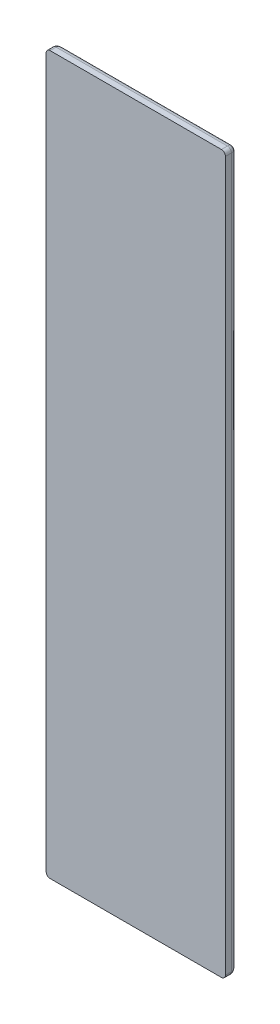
ISO-10303-21;
HEADER;
FILE_DESCRIPTION(('STEP AP214'),'2;1');
FILE_NAME('part.step','',(''),(''),'','','');
FILE_SCHEMA(('AUTOMOTIVE_DESIGN { 1 0 10303 214 1 1 1 1 }'));
ENDSEC;
DATA;
#1=APPLICATION_CONTEXT('core data for automotive mechanical design processes');
#2=APPLICATION_PROTOCOL_DEFINITION('international standard','automotive_design',2000,#1);
#3=PRODUCT_CONTEXT('',#1,'mechanical');
#4=PRODUCT('Part','Part','',(#3));
#5=PRODUCT_RELATED_PRODUCT_CATEGORY('part','',(#4));
#6=PRODUCT_DEFINITION_FORMATION('','',#4);
#7=PRODUCT_DEFINITION_CONTEXT('part definition',#1,'design');
#8=PRODUCT_DEFINITION('design','',#6,#7);
#9=PRODUCT_DEFINITION_SHAPE('','',#8);
#10=(LENGTH_UNIT() NAMED_UNIT(*) SI_UNIT(.MILLI.,.METRE.));
#11=(NAMED_UNIT(*) PLANE_ANGLE_UNIT() SI_UNIT($,.RADIAN.));
#12=(NAMED_UNIT(*) SI_UNIT($,.STERADIAN.) SOLID_ANGLE_UNIT());
#13=UNCERTAINTY_MEASURE_WITH_UNIT(LENGTH_MEASURE(1.E-05),#10,'distance_accuracy_value','');
#14=(GEOMETRIC_REPRESENTATION_CONTEXT(3) GLOBAL_UNCERTAINTY_ASSIGNED_CONTEXT((#13)) GLOBAL_UNIT_ASSIGNED_CONTEXT((#10,
#11,#12)) REPRESENTATION_CONTEXT('',''));
#15=CARTESIAN_POINT('',(0.,0.,0.));
#16=DIRECTION('',(0.,0.,1.));
#17=DIRECTION('',(1.,0.,0.));
#18=AXIS2_PLACEMENT_3D('',#15,#16,#17);
#19=CARTESIAN_POINT('',(21.5,-90.,1.5));
#20=CARTESIAN_POINT('',(21.6495996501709,-90.,1.5));
#21=CARTESIAN_POINT('',(21.8738175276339,-89.9486359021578,1.5));
#22=CARTESIAN_POINT('',(22.128698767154,-89.788318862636,1.5));
#23=CARTESIAN_POINT('',(22.3150612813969,-89.6021463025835,1.5));
#24=CARTESIAN_POINT('',(22.4618741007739,-89.3365606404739,1.5));
#25=CARTESIAN_POINT('',(22.5,-89.1121997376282,1.5));
#26=CARTESIAN_POINT('',(22.5,-89.,1.5));
#27=CARTESIAN_POINT('',(21.5,-90.,1.3878002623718));
#28=CARTESIAN_POINT('',(21.6495996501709,-90.,1.37658410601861));
#29=CARTESIAN_POINT('',(21.8738175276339,-89.9486359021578,1.36367785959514));
#30=CARTESIAN_POINT('',(22.128698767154,-89.788318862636,1.35659921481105));
#31=CARTESIAN_POINT('',(22.3150612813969,-89.6021463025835,1.35658906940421));
#32=CARTESIAN_POINT('',(22.4618741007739,-89.3365606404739,1.36547389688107));
#33=CARTESIAN_POINT('',(22.5,-89.1121997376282,1.37940644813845));
#34=CARTESIAN_POINT('',(22.5,-89.,1.3878002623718));
#35=CARTESIAN_POINT('',(21.493667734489,-89.9810032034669,1.219526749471));
#36=CARTESIAN_POINT('',(21.6388090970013,-89.9769920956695,1.19181888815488));
#37=CARTESIAN_POINT('',(21.8563490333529,-89.9220037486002,1.15996961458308));
#38=CARTESIAN_POINT('',(22.1051171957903,-89.7621005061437,1.14251311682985));
#39=CARTESIAN_POINT('',(22.2883852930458,-89.5790000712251,1.14248786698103));
#40=CARTESIAN_POINT('',(22.4356014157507,-89.3201946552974,1.16439795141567));
#41=CARTESIAN_POINT('',(22.4779774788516,-89.102519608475,1.19878721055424));
#42=CARTESIAN_POINT('',(22.4810032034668,-88.993667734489,1.21952674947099));
#43=CARTESIAN_POINT('',(21.4625698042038,-89.8877094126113,0.895595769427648));
#44=CARTESIAN_POINT('',(21.5887416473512,-89.8682079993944,0.846186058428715));
#45=CARTESIAN_POINT('',(21.777929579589,-89.8004923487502,0.789964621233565));
#46=CARTESIAN_POINT('',(21.9999211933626,-89.6445412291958,0.759269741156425));
#47=CARTESIAN_POINT('',(22.1687376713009,-89.4758439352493,0.759231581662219));
#48=CARTESIAN_POINT('',(22.3152374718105,-89.246456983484,0.797735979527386));
#49=CARTESIAN_POINT('',(22.3731260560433,-89.0572122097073,0.858603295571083));
#50=CARTESIAN_POINT('',(22.3877094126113,-88.9625698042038,0.895595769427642));
#51=CARTESIAN_POINT('',(21.3892697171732,-89.6678091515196,0.496993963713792));
#52=CARTESIAN_POINT('',(21.4789192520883,-89.623519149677,0.445950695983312));
#53=CARTESIAN_POINT('',(21.6134299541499,-89.5389404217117,0.389505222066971));
#54=CARTESIAN_POINT('',(21.7810385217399,-89.3980404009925,0.359032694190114));
#55=CARTESIAN_POINT('',(21.917580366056,-89.2615383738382,0.359011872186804));
#56=CARTESIAN_POINT('',(22.0546353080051,-89.0910155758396,0.397175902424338));
#57=CARTESIAN_POINT('',(22.1346752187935,-88.9565306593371,0.458745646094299));
#58=CARTESIAN_POINT('',(22.1678091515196,-88.8892697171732,0.49699396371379));
#59=CARTESIAN_POINT('',(21.224368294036,-89.1731048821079,0.10246851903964));
#60=CARTESIAN_POINT('',(21.2669560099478,-89.130154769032,0.088465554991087));
#61=CARTESIAN_POINT('',(21.3308756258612,-89.0659334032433,0.073741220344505));
#62=CARTESIAN_POINT('',(21.4162264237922,-88.9803112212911,0.065952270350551));
#63=CARTESIAN_POINT('',(21.4910125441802,-88.9055420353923,0.065954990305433));
#64=CARTESIAN_POINT('',(21.5766541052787,-88.8202186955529,0.075680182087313));
#65=CARTESIAN_POINT('',(21.6409618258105,-88.7563271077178,0.091957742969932));
#66=CARTESIAN_POINT('',(21.6731048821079,-88.724368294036,0.102468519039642));
#67=CARTESIAN_POINT('',(21.0747998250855,-88.7243994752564,0.));
#68=CARTESIAN_POINT('',(21.089047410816,-88.7101518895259,0.));
#69=CARTESIAN_POINT('',(21.1104187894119,-88.68878051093,0.));
#70=CARTESIAN_POINT('',(21.138913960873,-88.6602853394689,0.));
#71=CARTESIAN_POINT('',(21.1638472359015,-88.6353520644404,0.));
#72=CARTESIAN_POINT('',(21.1923424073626,-88.6068568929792,0.));
#73=CARTESIAN_POINT('',(21.2137137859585,-88.5854855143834,0.));
#74=CARTESIAN_POINT('',(21.2243994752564,-88.5747998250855,0.));
#75=CARTESIAN_POINT('',(21.,-88.5,0.));
#76=CARTESIAN_POINT('',(21.,-88.5,0.));
#77=CARTESIAN_POINT('',(21.,-88.5,0.));
#78=CARTESIAN_POINT('',(21.,-88.5,0.));
#79=CARTESIAN_POINT('',(21.,-88.5,0.));
#80=CARTESIAN_POINT('',(21.,-88.5,0.));
#81=CARTESIAN_POINT('',(21.,-88.5,0.));
#82=CARTESIAN_POINT('',(21.,-88.5,0.));
#83=B_SPLINE_SURFACE_WITH_KNOTS('',3,3,((#19,#20,#21,#22,#23,#24,#25,#26),(#27,#28,#29,#30,#31,
#32,#33,#34),(#35,#36,#37,#38,#39,#40,#41,#42),(#43,#44,#45,#46,#47,#48,#49,#50),(#51,#52,#53,
#54,#55,#56,#57,#58),(#59,#60,#61,#62,#63,#64,#65,#66),(#67,#68,#69,#70,#71,#72,#73,#74),(#75,
#76,#77,#78,#79,#80,#81,#82)),.UNSPECIFIED.,.F.,.F.,.F.,(4,1,1,1,1,4),(4,1,1,1,1,4),(0.,
0.224399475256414,0.336599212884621,0.673198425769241,1.12199737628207,1.5707963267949),(0.,
0.285714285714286,0.428571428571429,0.571428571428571,0.785714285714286,1.),.UNSPECIFIED.);
#84=CARTESIAN_POINT('',(21.,-88.5,0.));
#85=CARTESIAN_POINT('',(21.2243994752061,-88.5747998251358,0.));
#86=CARTESIAN_POINT('',(21.6731048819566,-88.7243682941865,0.102468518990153));
#87=CARTESIAN_POINT('',(22.1678091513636,-88.8892697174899,0.4969939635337));
#88=CARTESIAN_POINT('',(22.3877094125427,-88.9625698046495,0.895595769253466));
#89=CARTESIAN_POINT('',(22.4810032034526,-88.9936677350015,1.21952674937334));
#90=CARTESIAN_POINT('',(22.5,-89.0000000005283,1.38780026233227));
#91=CARTESIAN_POINT('',(22.5,-89.0000000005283,1.5));
#92=B_SPLINE_CURVE_WITH_KNOTS('',3,(#84,#85,#86,#87,#88,#89,#90,#91),.UNSPECIFIED.,.F.,.F.,(4,1,
1,1,1,4),(0.,0.448798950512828,0.897597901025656,1.23419711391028,1.34639685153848,
1.5707963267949),.UNSPECIFIED.);
#93=CARTESIAN_POINT('',(22.5,-89.0000000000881,1.5));
#94=VERTEX_POINT('',#93);
#95=CARTESIAN_POINT('',(21.,-88.5,0.));
#96=VERTEX_POINT('',#95);
#97=EDGE_CURVE('E113',#94,#96,#92,.F.);
#98=CARTESIAN_POINT('',(22.5,-89.,1.5));
#99=CARTESIAN_POINT('',(22.5,-89.1121997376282,1.5));
#100=CARTESIAN_POINT('',(22.4618741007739,-89.3365606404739,1.5));
#101=CARTESIAN_POINT('',(22.3150612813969,-89.6021463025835,1.5));
#102=CARTESIAN_POINT('',(22.128698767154,-89.788318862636,1.5));
#103=CARTESIAN_POINT('',(21.8738175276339,-89.9486359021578,1.5));
#104=CARTESIAN_POINT('',(21.6495996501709,-90.,1.5));
#105=CARTESIAN_POINT('',(21.5,-90.,1.5));
#106=B_SPLINE_CURVE_WITH_KNOTS('',3,(#98,#99,#100,#101,#102,#103,#104,#105),.UNSPECIFIED.,.F.,
.F.,(4,1,1,1,1,4),(0.,0.214285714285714,0.428571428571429,0.571428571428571,0.714285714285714,
1.),.UNSPECIFIED.);
#107=CARTESIAN_POINT('',(21.5,-90.,1.5));
#108=VERTEX_POINT('',#107);
#109=EDGE_CURVE('E96',#94,#108,#106,.T.);
#110=CARTESIAN_POINT('',(21.5,-90.,1.5));
#111=CARTESIAN_POINT('',(21.5000000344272,-90.0000001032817,1.48036481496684));
#112=CARTESIAN_POINT('',(21.4998707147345,-89.9996121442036,1.4607297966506));
#113=CARTESIAN_POINT('',(21.499354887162,-89.998064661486,1.42149068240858));
#114=CARTESIAN_POINT('',(21.4989683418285,-89.9969050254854,1.40188659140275));
#115=CARTESIAN_POINT('',(21.4979394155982,-89.9938182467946,1.3627392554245));
#116=CARTESIAN_POINT('',(21.4972969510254,-89.9918908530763,1.34319603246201));
#117=CARTESIAN_POINT('',(21.4957575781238,-89.9872727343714,1.30420023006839));
#118=CARTESIAN_POINT('',(21.494860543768,-89.984581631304,1.28474770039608));
#119=CARTESIAN_POINT('',(21.4928134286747,-89.9784402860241,1.2459630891));
#120=CARTESIAN_POINT('',(21.4916631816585,-89.9749895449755,1.22663109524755));
#121=CARTESIAN_POINT('',(21.4891109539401,-89.9673328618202,1.18811739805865));
#122=CARTESIAN_POINT('',(21.4877087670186,-89.9631263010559,1.1689358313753));
#123=CARTESIAN_POINT('',(21.4846543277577,-89.953962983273,1.13075268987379));
#124=CARTESIAN_POINT('',(21.4830018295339,-89.9490054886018,1.11175131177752));
#125=CARTESIAN_POINT('',(21.4794494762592,-89.9383484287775,1.07395747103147));
#126=CARTESIAN_POINT('',(21.4775493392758,-89.9326480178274,1.05516527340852));
#127=CARTESIAN_POINT('',(21.4735040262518,-89.9205120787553,1.0178190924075));
#128=CARTESIAN_POINT('',(21.4713585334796,-89.9140756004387,0.9992654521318));
#129=CARTESIAN_POINT('',(21.4668259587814,-89.9004778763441,0.962424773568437));
#130=CARTESIAN_POINT('',(21.4644385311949,-89.8933155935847,0.944138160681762));
#131=CARTESIAN_POINT('',(21.4594269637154,-89.8782808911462,0.907858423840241));
#132=CARTESIAN_POINT('',(21.4568024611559,-89.8704073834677,0.889865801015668));
#133=CARTESIAN_POINT('',(21.451321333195,-89.8539639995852,0.854201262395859));
#134=CARTESIAN_POINT('',(21.4484643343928,-89.8453930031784,0.836529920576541));
#135=CARTESIAN_POINT('',(21.4425228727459,-89.8275686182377,0.801535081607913));
#136=CARTESIAN_POINT('',(21.4394380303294,-89.8183140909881,0.784212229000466));
#137=CARTESIAN_POINT('',(21.4330455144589,-89.7991365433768,0.749941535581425));
#138=CARTESIAN_POINT('',(21.4297374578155,-89.7892123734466,0.732994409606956));
#139=CARTESIAN_POINT('',(21.4229031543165,-89.7687094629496,0.699502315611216));
#140=CARTESIAN_POINT('',(21.4193765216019,-89.7581295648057,0.682958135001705));
#141=CARTESIAN_POINT('',(21.4121096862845,-89.7363290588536,0.650299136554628));
#142=CARTESIAN_POINT('',(21.4083690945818,-89.7251072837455,0.634185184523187));
#143=CARTESIAN_POINT('',(21.4006790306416,-89.7020370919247,0.602413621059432));
#144=CARTESIAN_POINT('',(21.3967291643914,-89.6901874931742,0.586756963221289));
#145=CARTESIAN_POINT('',(21.3886250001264,-89.6658750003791,0.555927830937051));
#146=CARTESIAN_POINT('',(21.3844703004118,-89.6534109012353,0.540756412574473));
#147=CARTESIAN_POINT('',(21.3759640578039,-89.6278921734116,0.510917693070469));
#148=CARTESIAN_POINT('',(21.3716121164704,-89.6148363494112,0.496251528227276));
#149=CARTESIAN_POINT('',(21.3627193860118,-89.5881581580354,0.467441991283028));
#150=CARTESIAN_POINT('',(21.3581782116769,-89.5745346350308,0.453299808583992));
#151=CARTESIAN_POINT('',(21.3489148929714,-89.5467446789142,0.425557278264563));
#152=CARTESIAN_POINT('',(21.3441923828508,-89.5325771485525,0.411958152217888));
#153=CARTESIAN_POINT('',(21.334574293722,-89.5037228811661,0.385320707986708));
#154=CARTESIAN_POINT('',(21.3296783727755,-89.4890351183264,0.372283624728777));
#155=CARTESIAN_POINT('',(21.319721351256,-89.4591640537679,0.346789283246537));
#156=CARTESIAN_POINT('',(21.3146599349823,-89.4439798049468,0.334333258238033));
#157=CARTESIAN_POINT('',(21.3043798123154,-89.4131394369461,0.310020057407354));
#158=CARTESIAN_POINT('',(21.2991608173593,-89.3974824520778,0.298164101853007));
#159=CARTESIAN_POINT('',(21.2885734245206,-89.3657202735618,0.275070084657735));
#160=CARTESIAN_POINT('',(21.2832047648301,-89.3496142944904,0.263833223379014));
#161=CARTESIAN_POINT('',(21.2723259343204,-89.3169778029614,0.241996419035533));
#162=CARTESIAN_POINT('',(21.2668155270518,-89.3004465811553,0.231397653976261));
#163=CARTESIAN_POINT('',(21.2556610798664,-89.2669832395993,0.210856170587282));
#164=CARTESIAN_POINT('',(21.2500168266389,-89.2500504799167,0.200914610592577));
#165=CARTESIAN_POINT('',(21.2386026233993,-89.215807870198,0.181706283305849));
#166=CARTESIAN_POINT('',(21.2328324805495,-89.1984974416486,0.172440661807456));
#167=CARTESIAN_POINT('',(21.2211742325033,-89.1635226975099,0.154604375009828));
#168=CARTESIAN_POINT('',(21.2152859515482,-89.1458578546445,0.146034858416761));
#169=CARTESIAN_POINT('',(21.2034002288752,-89.1102006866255,0.129604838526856));
#170=CARTESIAN_POINT('',(21.1974026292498,-89.0922078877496,0.121745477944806));
#171=CARTESIAN_POINT('',(21.1853083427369,-89.0559250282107,0.106741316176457));
#172=CARTESIAN_POINT('',(21.1792115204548,-89.0376345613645,0.0995976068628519));
#173=CARTESIAN_POINT('',(21.1669286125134,-89.0007858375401,0.086032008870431));
#174=CARTESIAN_POINT('',(21.1607424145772,-88.9822272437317,0.079611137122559));
#175=CARTESIAN_POINT('',(21.1482906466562,-88.9448719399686,0.0674980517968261));
#176=CARTESIAN_POINT('',(21.1420249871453,-88.9260749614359,0.0618067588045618));
#177=CARTESIAN_POINT('',(21.129424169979,-88.888272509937,0.0511598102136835));
#178=CARTESIAN_POINT('',(21.1230889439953,-88.869266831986,0.0462049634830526));
#179=CARTESIAN_POINT('',(21.1103588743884,-88.8310766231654,0.0370378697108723));
#180=CARTESIAN_POINT('',(21.1039639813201,-88.8118919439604,0.0328263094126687));
#181=CARTESIAN_POINT('',(21.0911244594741,-88.7733733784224,0.0251527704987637));
#182=CARTESIAN_POINT('',(21.0846797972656,-88.7540393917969,0.0216913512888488));
#183=CARTESIAN_POINT('',(21.071750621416,-88.715251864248,0.015525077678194));
#184=CARTESIAN_POINT('',(21.0652660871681,-88.6957982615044,0.0128206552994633));
#185=CARTESIAN_POINT('',(21.0522670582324,-88.6568011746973,0.00817536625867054));
#186=CARTESIAN_POINT('',(21.0457525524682,-88.6372576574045,0.00623480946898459));
#187=CARTESIAN_POINT('',(21.032703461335,-88.5981103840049,0.00312421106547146));
#188=CARTESIAN_POINT('',(21.0261688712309,-88.5785066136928,0.00195436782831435));
#189=CARTESIAN_POINT('',(21.0130895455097,-88.5392686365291,0.00039224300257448));
#190=CARTESIAN_POINT('',(21.0065448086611,-88.5196344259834,6.46256730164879E-08));
#191=CARTESIAN_POINT('',(21.,-88.5,0.));
#192=B_SPLINE_CURVE_WITH_KNOTS('',3,(#110,#111,#112,#113,#114,#115,#116,#117,#118,#119,#120,
#121,#122,#123,#124,#125,#126,#127,#128,#129,#130,#131,#132,#133,#134,#135,#136,#137,#138,#139,
#140,#141,#142,#143,#144,#145,#146,#147,#148,#149,#150,#151,#152,#153,#154,#155,#156,#157,#158,
#159,#160,#161,#162,#163,#164,#165,#166,#167,#168,#169,#170,#171,#172,#173,#174,#175,#176,#177,
#178,#179,#180,#181,#182,#183,#184,#185,#186,#187,#188,#189,#190,#191),.UNSPECIFIED.,.F.,.F.,(4,
2,2,2,2,2,2,2,2,2,2,2,2,2,2,2,2,2,2,2,2,2,2,2,2,2,2,2,2,2,2,2,2,2,2,2,2,2,2,2,4),(0.,
0.0589010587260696,0.117810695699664,0.17673960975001,0.235697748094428,0.294694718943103,
0.353740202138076,0.412844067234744,0.472015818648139,0.531264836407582,0.590599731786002,
0.650026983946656,0.709551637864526,0.769177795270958,0.828909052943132,0.888748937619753,
0.948701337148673,1.0087709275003,1.06896340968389,1.12928343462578,1.18973290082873,
1.25031145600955,1.31101695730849,1.37184592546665,1.43279399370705,1.49385635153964,
1.55502818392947,1.61630510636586,1.67768359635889,1.73916139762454,1.80073642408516,
1.86240400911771,1.92415729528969,1.98598775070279,2.04788562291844,2.10984038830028,
2.1718411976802,2.23387731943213,2.29593858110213,2.35801581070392,2.42010127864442),.UNSPECIFIED.);
#193=EDGE_CURVE('E117',#96,#108,#192,.F.);
#194=ORIENTED_EDGE('',*,*,#97,.F.);
#195=ORIENTED_EDGE('',*,*,#109,.T.);
#196=ORIENTED_EDGE('',*,*,#193,.F.);
#197=EDGE_LOOP('',(#194,#195,#196));
#198=FACE_BOUND('',#197,.T.);
#199=ADVANCED_FACE('F16',(#198),#83,.T.);
#200=CARTESIAN_POINT('',(22.5,89.,1.5));
#201=CARTESIAN_POINT('',(22.5,89.1495996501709,1.5));
#202=CARTESIAN_POINT('',(22.4486359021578,89.373817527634,1.5));
#203=CARTESIAN_POINT('',(22.288318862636,89.628698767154,1.5));
#204=CARTESIAN_POINT('',(22.1021463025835,89.815061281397,1.5));
#205=CARTESIAN_POINT('',(21.8365606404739,89.9618741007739,1.5));
#206=CARTESIAN_POINT('',(21.6121997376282,90.,1.5));
#207=CARTESIAN_POINT('',(21.5,90.,1.5));
#208=CARTESIAN_POINT('',(22.5,89.,1.38780026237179));
#209=CARTESIAN_POINT('',(22.5,89.1495996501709,1.3765841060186));
#210=CARTESIAN_POINT('',(22.4486359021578,89.373817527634,1.36367785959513));
#211=CARTESIAN_POINT('',(22.288318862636,89.628698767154,1.35659921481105));
#212=CARTESIAN_POINT('',(22.1021463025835,89.815061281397,1.3565890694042));
#213=CARTESIAN_POINT('',(21.8365606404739,89.9618741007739,1.36547389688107));
#214=CARTESIAN_POINT('',(21.6121997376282,90.,1.37940644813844));
#215=CARTESIAN_POINT('',(21.5,90.,1.38780026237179));
#216=CARTESIAN_POINT('',(22.4747625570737,88.9915875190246,1.16338542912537));
#217=CARTESIAN_POINT('',(22.4692834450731,89.1351526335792,1.12989688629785));
#218=CARTESIAN_POINT('',(22.4129448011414,89.3503381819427,1.09139862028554));
#219=CARTESIAN_POINT('',(22.2530897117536,89.5969880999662,1.07029653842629));
#220=CARTESIAN_POINT('',(22.0710158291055,89.7792239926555,1.07026603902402));
#221=CARTESIAN_POINT('',(21.8145715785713,89.9266853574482,1.09675187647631));
#222=CARTESIAN_POINT('',(21.5992585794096,89.9706398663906,1.13831950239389));
#223=CARTESIAN_POINT('',(21.4915875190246,89.9747625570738,1.16338542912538));
#224=CARTESIAN_POINT('',(22.3628176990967,88.9542725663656,0.843755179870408));
#225=CARTESIAN_POINT('',(22.3396559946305,89.0757403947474,0.793168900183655));
#226=CARTESIAN_POINT('',(22.2691014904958,89.2578905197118,0.735815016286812));
#227=CARTESIAN_POINT('',(22.1144742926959,89.4731021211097,0.704545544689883));
#228=CARTESIAN_POINT('',(21.9495620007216,89.6381215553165,0.704508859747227));
#229=CARTESIAN_POINT('',(21.7275819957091,89.7840738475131,0.74372626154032));
#230=CARTESIAN_POINT('',(21.5453891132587,89.8454967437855,0.805877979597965));
#231=CARTESIAN_POINT('',(21.4542725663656,89.8628176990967,0.843755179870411));
#232=CARTESIAN_POINT('',(22.1227698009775,88.8742566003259,0.461143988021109));
#233=CARTESIAN_POINT('',(22.0786617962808,88.9596853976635,0.413712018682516));
#234=CARTESIAN_POINT('',(21.9960466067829,89.0878670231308,0.361347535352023));
#235=CARTESIAN_POINT('',(21.8602333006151,89.2480479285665,0.33309656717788));
#236=CARTESIAN_POINT('',(21.7293501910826,89.3789711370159,0.333078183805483));
#237=CARTESIAN_POINT('',(21.5665071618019,89.5112733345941,0.368456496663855));
#238=CARTESIAN_POINT('',(21.4383528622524,89.5897766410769,0.425599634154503));
#239=CARTESIAN_POINT('',(21.3742566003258,89.6227698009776,0.461143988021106));
#240=CARTESIAN_POINT('',(21.6731499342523,88.7243833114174,0.10246319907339));
#241=CARTESIAN_POINT('',(21.6301561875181,88.766924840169,0.088219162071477));
#242=CARTESIAN_POINT('',(21.5658590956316,88.830777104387,0.073201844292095));
#243=CARTESIAN_POINT('',(21.480183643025,88.9160923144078,0.065249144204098));
#244=CARTESIAN_POINT('',(21.4054065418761,88.9908860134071,0.065251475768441));
#245=CARTESIAN_POINT('',(21.3201307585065,89.0765927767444,0.075182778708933));
#246=CARTESIAN_POINT('',(21.2563079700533,89.1409756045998,0.091772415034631));
#247=CARTESIAN_POINT('',(21.2243833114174,89.1731499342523,0.102463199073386));
#248=CARTESIAN_POINT('',(21.2243994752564,88.5747998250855,0.));
#249=CARTESIAN_POINT('',(21.2101518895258,88.589047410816,0.));
#250=CARTESIAN_POINT('',(21.18878051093,88.6104187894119,0.));
#251=CARTESIAN_POINT('',(21.1602853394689,88.638913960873,0.));
#252=CARTESIAN_POINT('',(21.1353520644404,88.6638472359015,0.));
#253=CARTESIAN_POINT('',(21.1068568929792,88.6923424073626,0.));
#254=CARTESIAN_POINT('',(21.0854855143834,88.7137137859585,0.));
#255=CARTESIAN_POINT('',(21.0747998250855,88.7243994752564,0.));
#256=CARTESIAN_POINT('',(21.,88.5,0.));
#257=CARTESIAN_POINT('',(21.,88.5,0.));
#258=CARTESIAN_POINT('',(21.,88.5,0.));
#259=CARTESIAN_POINT('',(21.,88.5,0.));
#260=CARTESIAN_POINT('',(21.,88.5000000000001,0.));
#261=CARTESIAN_POINT('',(21.,88.5,0.));
#262=CARTESIAN_POINT('',(21.,88.5,0.));
#263=CARTESIAN_POINT('',(21.,88.5,0.));
#264=B_SPLINE_SURFACE_WITH_KNOTS('',3,3,((#200,#201,#202,#203,#204,#205,#206,#207),(#208,#209,
#210,#211,#212,#213,#214,#215),(#216,#217,#218,#219,#220,#221,#222,#223),(#224,#225,#226,#227,
#228,#229,#230,#231),(#232,#233,#234,#235,#236,#237,#238,#239),(#240,#241,#242,#243,#244,#245,
#246,#247),(#248,#249,#250,#251,#252,#253,#254,#255),(#256,#257,#258,#259,#260,#261,#262,#263)),
.UNSPECIFIED.,.F.,.F.,.F.,(4,1,1,1,1,4),(4,1,1,1,1,4),(0.,0.224399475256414,0.448798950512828,
0.673198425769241,1.12199737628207,1.5707963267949),(0.,0.285714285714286,0.428571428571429,
0.571428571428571,0.785714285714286,1.),.UNSPECIFIED.);
#265=CARTESIAN_POINT('',(21.,88.5,0.));
#266=CARTESIAN_POINT('',(21.0747998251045,88.7243994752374,0.));
#267=CARTESIAN_POINT('',(21.2243833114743,89.173149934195,0.102463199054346));
#268=CARTESIAN_POINT('',(21.37425660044,89.6227698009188,0.461143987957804));
#269=CARTESIAN_POINT('',(21.4542725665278,89.8628176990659,0.843755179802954));
#270=CARTESIAN_POINT('',(21.4915875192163,89.9747625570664,1.16338542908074));
#271=CARTESIAN_POINT('',(21.5000000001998,90.,1.38780026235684));
#272=CARTESIAN_POINT('',(21.5000000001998,90.,1.5));
#273=B_SPLINE_CURVE_WITH_KNOTS('',3,(#265,#266,#267,#268,#269,#270,#271,#272),.UNSPECIFIED.,.F.,
.F.,(4,1,1,1,1,4),(0.,0.448798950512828,0.897597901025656,1.12199737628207,1.34639685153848,
1.5707963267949),.UNSPECIFIED.);
#274=CARTESIAN_POINT('',(21.5000000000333,90.,1.5));
#275=VERTEX_POINT('',#274);
#276=CARTESIAN_POINT('',(21.,88.5,0.));
#277=VERTEX_POINT('',#276);
#278=EDGE_CURVE('E232',#275,#277,#273,.F.);
#279=CARTESIAN_POINT('',(21.5,90.,1.5));
#280=CARTESIAN_POINT('',(21.6121997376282,90.,1.5));
#281=CARTESIAN_POINT('',(21.8365606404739,89.9618741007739,1.5));
#282=CARTESIAN_POINT('',(22.1021463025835,89.815061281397,1.5));
#283=CARTESIAN_POINT('',(22.288318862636,89.628698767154,1.5));
#284=CARTESIAN_POINT('',(22.4486359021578,89.373817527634,1.5));
#285=CARTESIAN_POINT('',(22.5,89.1495996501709,1.5));
#286=CARTESIAN_POINT('',(22.5,89.,1.5));
#287=B_SPLINE_CURVE_WITH_KNOTS('',3,(#279,#280,#281,#282,#283,#284,#285,#286),.UNSPECIFIED.,.F.,
.F.,(4,1,1,1,1,4),(0.,0.214285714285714,0.428571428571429,0.571428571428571,0.714285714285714,
1.),.UNSPECIFIED.);
#288=CARTESIAN_POINT('',(22.5,89.,1.5));
#289=VERTEX_POINT('',#288);
#290=EDGE_CURVE('E109',#275,#289,#287,.T.);
#291=CARTESIAN_POINT('',(22.5,89.,1.5));
#292=CARTESIAN_POINT('',(22.5000000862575,89.0000000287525,1.4803642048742));
#293=CARTESIAN_POINT('',(22.4996135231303,88.9998711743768,1.46072852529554));
#294=CARTESIAN_POINT('',(22.4980705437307,88.9993568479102,1.42148712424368));
#295=CARTESIAN_POINT('',(22.4969139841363,88.9989713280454,1.40188140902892));
#296=CARTESIAN_POINT('',(22.4938339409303,88.9979446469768,1.36273040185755));
#297=CARTESIAN_POINT('',(22.4919101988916,88.9973033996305,1.34318513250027));
#298=CARTESIAN_POINT('',(22.4872987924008,88.9957662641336,1.30418540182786));
#299=CARTESIAN_POINT('',(22.484610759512,88.9948702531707,1.28473098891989));
#300=CARTESIAN_POINT('',(22.4784739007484,88.9928246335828,1.24594333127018));
#301=CARTESIAN_POINT('',(22.4750245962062,88.9916748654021,1.22661017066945));
#302=CARTESIAN_POINT('',(22.4673677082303,88.9891225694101,1.18809549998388));
#303=CARTESIAN_POINT('',(22.4631595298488,88.9877198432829,1.16891412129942));
#304=CARTESIAN_POINT('',(22.4539899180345,88.9846633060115,1.13073287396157));
#305=CARTESIAN_POINT('',(22.4490277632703,88.9830092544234,1.11173319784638));
#306=CARTESIAN_POINT('',(22.438361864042,88.9794539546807,1.0739431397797));
#307=CARTESIAN_POINT('',(22.4326572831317,88.9775524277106,1.05515302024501));
#308=CARTESIAN_POINT('',(22.4205171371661,88.9735057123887,1.01781003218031));
#309=CARTESIAN_POINT('',(22.4140806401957,88.9713602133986,0.999257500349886));
#310=CARTESIAN_POINT('',(22.4004874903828,88.966829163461,0.962417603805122));
#311=CARTESIAN_POINT('',(22.3933298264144,88.9644432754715,0.944130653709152));
#312=CARTESIAN_POINT('',(22.3783052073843,88.9594350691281,0.907849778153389));
#313=CARTESIAN_POINT('',(22.3704371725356,88.9568123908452,0.889856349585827));
#314=CARTESIAN_POINT('',(22.3540022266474,88.9513340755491,0.854190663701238));
#315=CARTESIAN_POINT('',(22.3454341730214,88.9484780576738,0.836518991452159));
#316=CARTESIAN_POINT('',(22.3276123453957,88.9425374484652,0.801524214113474));
#317=CARTESIAN_POINT('',(22.3183573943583,88.9394524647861,0.784201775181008));
#318=CARTESIAN_POINT('',(22.2991768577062,88.9330589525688,0.749932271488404));
#319=CARTESIAN_POINT('',(22.2892500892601,88.9297500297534,0.732985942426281));
#320=CARTESIAN_POINT('',(22.2687406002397,88.9229135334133,0.699495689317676));
#321=CARTESIAN_POINT('',(22.2581566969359,88.9193855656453,0.682952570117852));
#322=CARTESIAN_POINT('',(22.236347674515,88.912115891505,0.650295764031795));
#323=CARTESIAN_POINT('',(22.225121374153,88.9083737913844,0.634182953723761));
#324=CARTESIAN_POINT('',(22.2020424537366,88.9006808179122,0.602413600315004));
#325=CARTESIAN_POINT('',(22.1901886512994,88.8967295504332,0.586758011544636));
#326=CARTESIAN_POINT('',(22.1658689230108,88.8886229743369,0.555930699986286));
#327=CARTESIAN_POINT('',(22.1534018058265,88.8844672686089,0.540760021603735));
#328=CARTESIAN_POINT('',(22.1278781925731,88.8759593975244,0.510922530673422));
#329=CARTESIAN_POINT('',(22.1148205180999,88.8716068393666,0.496256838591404));
#330=CARTESIAN_POINT('',(22.0881396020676,88.8627132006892,0.467448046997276));
#331=CARTESIAN_POINT('',(22.0745152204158,88.8581717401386,0.45330612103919));
#332=CARTESIAN_POINT('',(22.0467243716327,88.8489081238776,0.42556393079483));
#333=CARTESIAN_POINT('',(22.0325568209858,88.8441856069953,0.411964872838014));
#334=CARTESIAN_POINT('',(22.0037031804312,88.8345677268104,0.385327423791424));
#335=CARTESIAN_POINT('',(21.9890160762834,88.8296720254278,0.372290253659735));
#336=CARTESIAN_POINT('',(21.9591468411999,88.8197156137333,0.34679562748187));
#337=CARTESIAN_POINT('',(21.9439637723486,88.8146545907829,0.334339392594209));
#338=CARTESIAN_POINT('',(21.9131261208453,88.8043753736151,0.310025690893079));
#339=CARTESIAN_POINT('',(21.897470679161,88.7991568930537,0.29816943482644));
#340=CARTESIAN_POINT('',(21.8657117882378,88.7885705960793,0.275074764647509));
#341=CARTESIAN_POINT('',(21.8496075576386,88.7832025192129,0.263837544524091));
#342=CARTESIAN_POINT('',(21.8169746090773,88.7723248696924,0.241999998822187));
#343=CARTESIAN_POINT('',(21.8004451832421,88.7668150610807,0.231400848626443));
#344=CARTESIAN_POINT('',(21.7669853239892,88.7556617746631,0.210858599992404));
#345=CARTESIAN_POINT('',(21.7500542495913,88.7500180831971,0.20091666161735));
#346=CARTESIAN_POINT('',(21.7158147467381,88.7386049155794,0.181707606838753));
#347=CARTESIAN_POINT('',(21.6985057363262,88.7328352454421,0.172441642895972));
#348=CARTESIAN_POINT('',(21.6635334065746,88.7211778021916,0.154604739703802));
#349=CARTESIAN_POINT('',(21.6458695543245,88.7152898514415,0.146034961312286));
#350=CARTESIAN_POINT('',(21.6102138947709,88.7034046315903,0.12960449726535));
#351=CARTESIAN_POINT('',(21.5922216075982,88.6974072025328,0.121744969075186));
#352=CARTESIAN_POINT('',(21.5559393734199,88.6853131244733,0.106740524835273));
#353=CARTESIAN_POINT('',(21.5376490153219,88.6792163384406,0.0995967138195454));
#354=CARTESIAN_POINT('',(21.5008001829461,88.6669333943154,0.0860309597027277));
#355=CARTESIAN_POINT('',(21.4822413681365,88.6607471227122,0.0796100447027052));
#356=CARTESIAN_POINT('',(21.4448853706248,88.6482951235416,0.0674969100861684));
#357=CARTESIAN_POINT('',(21.426087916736,88.6420293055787,0.0618056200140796));
#358=CARTESIAN_POINT('',(21.3882843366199,88.6294281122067,0.0511587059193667));
#359=CARTESIAN_POINT('',(21.36927800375,88.6230926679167,0.0462038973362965));
#360=CARTESIAN_POINT('',(21.3310863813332,88.610362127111,0.0370368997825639));
#361=CARTESIAN_POINT('',(21.311900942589,88.603966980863,0.0328254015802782));
#362=CARTESIAN_POINT('',(21.2733808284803,88.5911269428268,0.0251519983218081));
#363=CARTESIAN_POINT('',(21.2540460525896,88.5846820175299,0.0216906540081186));
#364=CARTESIAN_POINT('',(21.2152569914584,88.5717523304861,0.0155245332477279));
#365=CARTESIAN_POINT('',(21.1958026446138,88.5652675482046,0.0128201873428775));
#366=CARTESIAN_POINT('',(21.1568041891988,88.5522680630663,0.00817504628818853));
#367=CARTESIAN_POINT('',(21.1372600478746,88.5457533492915,0.00623455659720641));
#368=CARTESIAN_POINT('',(21.0981117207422,88.5327039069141,0.00312407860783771));
#369=CARTESIAN_POINT('',(21.0785075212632,88.5261691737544,0.00195428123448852));
#370=CARTESIAN_POINT('',(21.03926895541,88.5130896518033,0.000392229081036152));
#371=CARTESIAN_POINT('',(21.0196345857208,88.5065448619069,6.6931341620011E-08));
#372=CARTESIAN_POINT('',(21.,88.5,0.));
#373=B_SPLINE_CURVE_WITH_KNOTS('',3,(#291,#292,#293,#294,#295,#296,#297,#298,#299,#300,#301,
#302,#303,#304,#305,#306,#307,#308,#309,#310,#311,#312,#313,#314,#315,#316,#317,#318,#319,#320,
#321,#322,#323,#324,#325,#326,#327,#328,#329,#330,#331,#332,#333,#334,#335,#336,#337,#338,#339,
#340,#341,#342,#343,#344,#345,#346,#347,#348,#349,#350,#351,#352,#353,#354,#355,#356,#357,#358,
#359,#360,#361,#362,#363,#364,#365,#366,#367,#368,#369,#370,#371,#372),.UNSPECIFIED.,.F.,.F.,(4,
2,2,2,2,2,2,2,2,2,2,2,2,2,2,2,2,2,2,2,2,2,2,2,2,2,2,2,2,2,2,2,2,2,2,2,2,2,2,2,4),(0.,
0.0589029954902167,0.117816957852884,0.176750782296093,0.235713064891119,0.294712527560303,
0.353758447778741,0.412861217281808,0.472031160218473,0.531277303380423,0.590607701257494,
0.650029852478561,0.709551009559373,0.769176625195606,0.828910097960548,0.888754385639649,
0.948712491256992,1.00878790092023,1.06898500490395,1.12930803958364,1.1897589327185,
1.25033742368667,1.31104151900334,1.37186794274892,1.43281258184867,1.49387092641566,
1.55503850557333,1.61631131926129,1.67768626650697,1.73916153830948,1.80073525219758,
1.8624026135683,1.92415659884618,1.98598849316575,2.04788834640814,2.10984542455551,
2.17184865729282,2.23388708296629,2.29595029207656,2.35802887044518,2.42011484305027),.UNSPECIFIED.);
#374=EDGE_CURVE('E124',#277,#289,#373,.F.);
#375=ORIENTED_EDGE('',*,*,#278,.F.);
#376=ORIENTED_EDGE('',*,*,#290,.T.);
#377=ORIENTED_EDGE('',*,*,#374,.F.);
#378=EDGE_LOOP('',(#375,#376,#377));
#379=FACE_BOUND('',#378,.T.);
#380=ADVANCED_FACE('F332',(#379),#264,.T.);
#381=CARTESIAN_POINT('',(-21.5,90.,1.5));
#382=CARTESIAN_POINT('',(-21.6495996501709,90.,1.5));
#383=CARTESIAN_POINT('',(-21.8738175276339,89.9486359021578,1.5));
#384=CARTESIAN_POINT('',(-22.128698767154,89.788318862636,1.5));
#385=CARTESIAN_POINT('',(-22.3150612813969,89.6021463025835,1.5));
#386=CARTESIAN_POINT('',(-22.4618741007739,89.3365606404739,1.5));
#387=CARTESIAN_POINT('',(-22.5,89.1121997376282,1.5));
#388=CARTESIAN_POINT('',(-22.5,89.,1.5));
#389=CARTESIAN_POINT('',(-21.5,90.,1.3878002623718));
#390=CARTESIAN_POINT('',(-21.6495996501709,90.,1.37658410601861));
#391=CARTESIAN_POINT('',(-21.8738175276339,89.9486359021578,1.36367785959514));
#392=CARTESIAN_POINT('',(-22.128698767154,89.788318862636,1.35659921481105));
#393=CARTESIAN_POINT('',(-22.3150612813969,89.6021463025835,1.35658906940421));
#394=CARTESIAN_POINT('',(-22.4618741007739,89.3365606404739,1.36547389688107));
#395=CARTESIAN_POINT('',(-22.5,89.1121997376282,1.37940644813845));
#396=CARTESIAN_POINT('',(-22.5,89.,1.3878002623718));
#397=CARTESIAN_POINT('',(-21.4915875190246,89.9747625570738,1.16338542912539));
#398=CARTESIAN_POINT('',(-21.6351526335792,89.9692834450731,1.12989688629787));
#399=CARTESIAN_POINT('',(-21.8503381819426,89.9129448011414,1.09139862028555));
#400=CARTESIAN_POINT('',(-22.0969880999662,89.7530897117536,1.0702965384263));
#401=CARTESIAN_POINT('',(-22.2792239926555,89.5710158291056,1.07026603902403));
#402=CARTESIAN_POINT('',(-22.4266853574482,89.3145715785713,1.09675187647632));
#403=CARTESIAN_POINT('',(-22.4706398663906,89.0992585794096,1.1383195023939));
#404=CARTESIAN_POINT('',(-22.4747625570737,88.9915875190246,1.16338542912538));
#405=CARTESIAN_POINT('',(-21.4542725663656,89.8628176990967,0.843755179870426));
#406=CARTESIAN_POINT('',(-21.5757403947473,89.8396559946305,0.793168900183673));
#407=CARTESIAN_POINT('',(-21.7578905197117,89.7691014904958,0.735815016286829));
#408=CARTESIAN_POINT('',(-21.9731021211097,89.6144742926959,0.7045455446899));
#409=CARTESIAN_POINT('',(-22.1381215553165,89.4495620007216,0.704508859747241));
#410=CARTESIAN_POINT('',(-22.2840738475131,89.2275819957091,0.743726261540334));
#411=CARTESIAN_POINT('',(-22.3454967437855,89.0453891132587,0.805877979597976));
#412=CARTESIAN_POINT('',(-22.3628176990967,88.9542725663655,0.843755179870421));
#413=CARTESIAN_POINT('',(-21.3742566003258,89.6227698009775,0.461143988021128));
#414=CARTESIAN_POINT('',(-21.4596853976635,89.5786617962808,0.413712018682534));
#415=CARTESIAN_POINT('',(-21.5878670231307,89.4960466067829,0.36134753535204));
#416=CARTESIAN_POINT('',(-21.7480479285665,89.3602333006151,0.333096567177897));
#417=CARTESIAN_POINT('',(-21.8789711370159,89.2293501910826,0.3330781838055));
#418=CARTESIAN_POINT('',(-22.0112733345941,89.0665071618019,0.368456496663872));
#419=CARTESIAN_POINT('',(-22.0897766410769,88.9383528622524,0.425599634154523));
#420=CARTESIAN_POINT('',(-22.1227698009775,88.8742566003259,0.461143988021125));
#421=CARTESIAN_POINT('',(-21.2243833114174,89.1731499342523,0.102463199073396));
#422=CARTESIAN_POINT('',(-21.266924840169,89.1301561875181,0.088219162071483));
#423=CARTESIAN_POINT('',(-21.330777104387,89.0658590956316,0.073201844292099));
#424=CARTESIAN_POINT('',(-21.4160923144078,88.980183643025,0.065249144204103));
#425=CARTESIAN_POINT('',(-21.4908860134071,88.9054065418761,0.065251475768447));
#426=CARTESIAN_POINT('',(-21.5765927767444,88.8201307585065,0.075182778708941));
#427=CARTESIAN_POINT('',(-21.6409756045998,88.7563079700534,0.091772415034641));
#428=CARTESIAN_POINT('',(-21.6731499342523,88.7243833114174,0.102463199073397));
#429=CARTESIAN_POINT('',(-21.0747998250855,88.7243994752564,0.));
#430=CARTESIAN_POINT('',(-21.089047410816,88.7101518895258,0.));
#431=CARTESIAN_POINT('',(-21.1104187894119,88.68878051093,0.));
#432=CARTESIAN_POINT('',(-21.138913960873,88.6602853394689,0.));
#433=CARTESIAN_POINT('',(-21.1638472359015,88.6353520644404,0.));
#434=CARTESIAN_POINT('',(-21.1923424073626,88.6068568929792,0.));
#435=CARTESIAN_POINT('',(-21.2137137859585,88.5854855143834,0.));
#436=CARTESIAN_POINT('',(-21.2243994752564,88.5747998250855,0.));
#437=CARTESIAN_POINT('',(-21.,88.5,0.));
#438=CARTESIAN_POINT('',(-21.,88.5,0.));
#439=CARTESIAN_POINT('',(-21.,88.5,0.));
#440=CARTESIAN_POINT('',(-21.,88.5,0.));
#441=CARTESIAN_POINT('',(-21.,88.5,0.));
#442=CARTESIAN_POINT('',(-21.,88.5,0.));
#443=CARTESIAN_POINT('',(-21.,88.5,0.));
#444=CARTESIAN_POINT('',(-21.,88.5,0.));
#445=B_SPLINE_SURFACE_WITH_KNOTS('',3,3,((#381,#382,#383,#384,#385,#386,#387,#388),(#389,#390,
#391,#392,#393,#394,#395,#396),(#397,#398,#399,#400,#401,#402,#403,#404),(#405,#406,#407,#408,
#409,#410,#411,#412),(#413,#414,#415,#416,#417,#418,#419,#420),(#421,#422,#423,#424,#425,#426,
#427,#428),(#429,#430,#431,#432,#433,#434,#435,#436),(#437,#438,#439,#440,#441,#442,#443,#444)),
.UNSPECIFIED.,.F.,.F.,.F.,(4,1,1,1,1,4),(4,1,1,1,1,4),(0.,0.224399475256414,0.448798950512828,
0.673198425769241,1.12199737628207,1.5707963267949),(0.,0.285714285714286,0.428571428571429,
0.571428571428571,0.785714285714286,1.),.UNSPECIFIED.);
#446=CARTESIAN_POINT('',(-21.,88.5,0.));
#447=CARTESIAN_POINT('',(-21.2243994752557,88.5747998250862,0.));
#448=CARTESIAN_POINT('',(-21.6731499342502,88.7243833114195,0.102463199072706));
#449=CARTESIAN_POINT('',(-22.1227698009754,88.87425660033,0.461143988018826));
#450=CARTESIAN_POINT('',(-22.3628176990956,88.9542725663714,0.843755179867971));
#451=CARTESIAN_POINT('',(-22.4747625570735,88.9915875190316,1.16338542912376));
#452=CARTESIAN_POINT('',(-22.5,89.0000000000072,1.38780026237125));
#453=CARTESIAN_POINT('',(-22.5,89.0000000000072,1.5));
#454=B_SPLINE_CURVE_WITH_KNOTS('',3,(#446,#447,#448,#449,#450,#451,#452,#453),.UNSPECIFIED.,.F.,
.F.,(4,1,1,1,1,4),(0.,0.448798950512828,0.897597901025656,1.12199737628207,1.34639685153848,
1.5707963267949),.UNSPECIFIED.);
#455=CARTESIAN_POINT('',(-22.5,89.,1.5));
#456=VERTEX_POINT('',#455);
#457=CARTESIAN_POINT('',(-21.,88.5,0.));
#458=VERTEX_POINT('',#457);
#459=EDGE_CURVE('E171',#456,#458,#454,.F.);
#460=CARTESIAN_POINT('',(-22.5,89.,1.5));
#461=CARTESIAN_POINT('',(-22.5,89.1121997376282,1.5));
#462=CARTESIAN_POINT('',(-22.4618741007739,89.3365606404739,1.5));
#463=CARTESIAN_POINT('',(-22.3150612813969,89.6021463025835,1.5));
#464=CARTESIAN_POINT('',(-22.128698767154,89.788318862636,1.5));
#465=CARTESIAN_POINT('',(-21.8738175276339,89.9486359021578,1.5));
#466=CARTESIAN_POINT('',(-21.6495996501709,90.,1.5));
#467=CARTESIAN_POINT('',(-21.5,90.,1.5));
#468=B_SPLINE_CURVE_WITH_KNOTS('',3,(#460,#461,#462,#463,#464,#465,#466,#467),.UNSPECIFIED.,.F.,
.F.,(4,1,1,1,1,4),(0.,0.214285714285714,0.428571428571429,0.571428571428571,0.714285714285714,
1.),.UNSPECIFIED.);
#469=CARTESIAN_POINT('',(-21.5,90.,1.5));
#470=VERTEX_POINT('',#469);
#471=EDGE_CURVE('E360',#456,#470,#468,.T.);
#472=CARTESIAN_POINT('',(-21.5,90.,1.5));
#473=CARTESIAN_POINT('',(-21.5000000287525,90.0000000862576,1.4803642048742));
#474=CARTESIAN_POINT('',(-21.4998711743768,89.9996135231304,1.46072852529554));
#475=CARTESIAN_POINT('',(-21.4993568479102,89.9980705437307,1.42148712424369));
#476=CARTESIAN_POINT('',(-21.4989713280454,89.9969139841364,1.40188140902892));
#477=CARTESIAN_POINT('',(-21.4979446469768,89.9938339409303,1.36273040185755));
#478=CARTESIAN_POINT('',(-21.4973033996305,89.9919101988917,1.34318513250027));
#479=CARTESIAN_POINT('',(-21.4957662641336,89.9872987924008,1.30418540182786));
#480=CARTESIAN_POINT('',(-21.4948702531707,89.984610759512,1.2847309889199));
#481=CARTESIAN_POINT('',(-21.4928246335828,89.9784739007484,1.24594333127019));
#482=CARTESIAN_POINT('',(-21.4916748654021,89.9750245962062,1.22661017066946));
#483=CARTESIAN_POINT('',(-21.4891225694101,89.9673677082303,1.18809549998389));
#484=CARTESIAN_POINT('',(-21.4877198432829,89.9631595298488,1.16891412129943));
#485=CARTESIAN_POINT('',(-21.4846633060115,89.9539899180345,1.13073287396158));
#486=CARTESIAN_POINT('',(-21.4830092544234,89.9490277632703,1.11173319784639));
#487=CARTESIAN_POINT('',(-21.4794539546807,89.938361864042,1.07394313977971));
#488=CARTESIAN_POINT('',(-21.4775524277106,89.9326572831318,1.05515302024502));
#489=CARTESIAN_POINT('',(-21.4735057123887,89.9205171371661,1.01781003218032));
#490=CARTESIAN_POINT('',(-21.4713602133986,89.9140806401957,0.999257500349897));
#491=CARTESIAN_POINT('',(-21.4668291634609,89.9004874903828,0.962417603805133));
#492=CARTESIAN_POINT('',(-21.4644432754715,89.8933298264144,0.944130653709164));
#493=CARTESIAN_POINT('',(-21.4594350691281,89.8783052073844,0.907849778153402));
#494=CARTESIAN_POINT('',(-21.4568123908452,89.8704371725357,0.889856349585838));
#495=CARTESIAN_POINT('',(-21.4513340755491,89.8540022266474,0.854190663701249));
#496=CARTESIAN_POINT('',(-21.4484780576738,89.8454341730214,0.836518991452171));
#497=CARTESIAN_POINT('',(-21.4425374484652,89.8276123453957,0.801524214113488));
#498=CARTESIAN_POINT('',(-21.4394524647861,89.8183573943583,0.784201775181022));
#499=CARTESIAN_POINT('',(-21.4330589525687,89.7991768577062,0.749932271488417));
#500=CARTESIAN_POINT('',(-21.4297500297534,89.7892500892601,0.732985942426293));
#501=CARTESIAN_POINT('',(-21.4229135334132,89.7687406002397,0.699495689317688));
#502=CARTESIAN_POINT('',(-21.4193855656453,89.7581566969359,0.682952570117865));
#503=CARTESIAN_POINT('',(-21.412115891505,89.736347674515,0.650295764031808));
#504=CARTESIAN_POINT('',(-21.4083737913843,89.725121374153,0.634182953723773));
#505=CARTESIAN_POINT('',(-21.4006808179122,89.7020424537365,0.602413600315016));
#506=CARTESIAN_POINT('',(-21.3967295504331,89.6901886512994,0.586758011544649));
#507=CARTESIAN_POINT('',(-21.3886229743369,89.6658689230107,0.555930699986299));
#508=CARTESIAN_POINT('',(-21.3844672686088,89.6534018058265,0.540760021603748));
#509=CARTESIAN_POINT('',(-21.3759593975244,89.6278781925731,0.510922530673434));
#510=CARTESIAN_POINT('',(-21.3716068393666,89.6148205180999,0.496256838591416));
#511=CARTESIAN_POINT('',(-21.3627132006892,89.5881396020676,0.467448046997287));
#512=CARTESIAN_POINT('',(-21.3581717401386,89.5745152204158,0.453306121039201));
#513=CARTESIAN_POINT('',(-21.3489081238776,89.5467243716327,0.425563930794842));
#514=CARTESIAN_POINT('',(-21.3441856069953,89.5325568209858,0.411964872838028));
#515=CARTESIAN_POINT('',(-21.3345677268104,89.5037031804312,0.385327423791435));
#516=CARTESIAN_POINT('',(-21.3296720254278,89.4890160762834,0.372290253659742));
#517=CARTESIAN_POINT('',(-21.3197156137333,89.4591468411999,0.346795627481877));
#518=CARTESIAN_POINT('',(-21.3146545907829,89.4439637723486,0.33433939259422));
#519=CARTESIAN_POINT('',(-21.3043753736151,89.4131261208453,0.310025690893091));
#520=CARTESIAN_POINT('',(-21.2991568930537,89.397470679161,0.298169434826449));
#521=CARTESIAN_POINT('',(-21.2885705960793,89.3657117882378,0.275074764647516));
#522=CARTESIAN_POINT('',(-21.2832025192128,89.3496075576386,0.2638375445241));
#523=CARTESIAN_POINT('',(-21.2723248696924,89.3169746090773,0.241999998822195));
#524=CARTESIAN_POINT('',(-21.2668150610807,89.3004451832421,0.231400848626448));
#525=CARTESIAN_POINT('',(-21.2556617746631,89.2669853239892,0.210858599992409));
#526=CARTESIAN_POINT('',(-21.2500180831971,89.2500542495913,0.200916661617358));
#527=CARTESIAN_POINT('',(-21.2386049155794,89.2158147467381,0.181707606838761));
#528=CARTESIAN_POINT('',(-21.2328352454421,89.1985057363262,0.172441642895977));
#529=CARTESIAN_POINT('',(-21.2211778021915,89.1635334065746,0.154604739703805));
#530=CARTESIAN_POINT('',(-21.2152898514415,89.1458695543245,0.146034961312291));
#531=CARTESIAN_POINT('',(-21.2034046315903,89.1102138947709,0.129604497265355));
#532=CARTESIAN_POINT('',(-21.1974072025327,89.0922216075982,0.12174496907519));
#533=CARTESIAN_POINT('',(-21.1853131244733,89.0559393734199,0.106740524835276));
#534=CARTESIAN_POINT('',(-21.1792163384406,89.0376490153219,0.099596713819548));
#535=CARTESIAN_POINT('',(-21.1669333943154,89.0008001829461,0.0860309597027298));
#536=CARTESIAN_POINT('',(-21.1607471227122,88.9822413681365,0.0796100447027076));
#537=CARTESIAN_POINT('',(-21.1482951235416,88.9448853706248,0.067496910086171));
#538=CARTESIAN_POINT('',(-21.1420293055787,88.926087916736,0.0618056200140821));
#539=CARTESIAN_POINT('',(-21.1294281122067,88.8882843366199,0.0511587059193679));
#540=CARTESIAN_POINT('',(-21.1230926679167,88.86927800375,0.0462038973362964));
#541=CARTESIAN_POINT('',(-21.1103621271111,88.8310863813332,0.0370368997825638));
#542=CARTESIAN_POINT('',(-21.103966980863,88.811900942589,0.0328254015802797));
#543=CARTESIAN_POINT('',(-21.0911269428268,88.7733808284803,0.0251519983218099));
#544=CARTESIAN_POINT('',(-21.0846820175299,88.7540460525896,0.0216906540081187));
#545=CARTESIAN_POINT('',(-21.0717523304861,88.7152569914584,0.0155245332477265));
#546=CARTESIAN_POINT('',(-21.0652675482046,88.6958026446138,0.0128201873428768));
#547=CARTESIAN_POINT('',(-21.0522680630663,88.6568041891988,0.00817504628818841));
#548=CARTESIAN_POINT('',(-21.0457533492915,88.6372600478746,0.00623455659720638));
#549=CARTESIAN_POINT('',(-21.0327039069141,88.5981117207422,0.00312407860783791));
#550=CARTESIAN_POINT('',(-21.0261691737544,88.5785075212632,0.00195428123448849));
#551=CARTESIAN_POINT('',(-21.0130896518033,88.53926895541,0.000392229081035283));
#552=CARTESIAN_POINT('',(-21.0065448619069,88.5196345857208,6.69313405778E-08));
#553=CARTESIAN_POINT('',(-21.,88.5,0.));
#554=B_SPLINE_CURVE_WITH_KNOTS('',3,(#472,#473,#474,#475,#476,#477,#478,#479,#480,#481,#482,
#483,#484,#485,#486,#487,#488,#489,#490,#491,#492,#493,#494,#495,#496,#497,#498,#499,#500,#501,
#502,#503,#504,#505,#506,#507,#508,#509,#510,#511,#512,#513,#514,#515,#516,#517,#518,#519,#520,
#521,#522,#523,#524,#525,#526,#527,#528,#529,#530,#531,#532,#533,#534,#535,#536,#537,#538,#539,
#540,#541,#542,#543,#544,#545,#546,#547,#548,#549,#550,#551,#552,#553),.UNSPECIFIED.,.F.,.F.,(4,
2,2,2,2,2,2,2,2,2,2,2,2,2,2,2,2,2,2,2,2,2,2,2,2,2,2,2,2,2,2,2,2,2,2,2,2,2,2,2,4),(0.,
0.0589029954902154,0.117816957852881,0.176750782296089,0.235713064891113,0.294712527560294,
0.353758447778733,0.412861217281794,0.472031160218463,0.531277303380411,0.590607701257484,
0.650029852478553,0.709551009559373,0.769176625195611,0.828910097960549,0.888754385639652,
0.948712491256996,1.00878790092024,1.06898500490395,1.12930803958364,1.1897589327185,
1.25033742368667,1.31104151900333,1.37186794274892,1.43281258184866,1.49387092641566,
1.55503850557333,1.6163113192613,1.67768626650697,1.73916153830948,1.80073525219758,
1.86240261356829,1.92415659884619,1.98598849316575,2.04788834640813,2.10984542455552,
2.1718486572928,2.23388708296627,2.29595029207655,2.35802887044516,2.42011484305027),.UNSPECIFIED.);
#555=EDGE_CURVE('E219',#458,#470,#554,.F.);
#556=ORIENTED_EDGE('',*,*,#459,.F.);
#557=ORIENTED_EDGE('',*,*,#471,.T.);
#558=ORIENTED_EDGE('',*,*,#555,.F.);
#559=EDGE_LOOP('',(#556,#557,#558));
#560=FACE_BOUND('',#559,.T.);
#561=ADVANCED_FACE('F320',(#560),#445,.T.);
#562=CARTESIAN_POINT('',(0.,0.,0.));
#563=DIRECTION('',(0.,0.,1.));
#564=DIRECTION('',(1.,0.,0.));
#565=AXIS2_PLACEMENT_3D('',#562,#563,#564);
#566=PLANE('',#565);
#567=DIRECTION('',(0.,-1.,0.));
#568=VECTOR('',#567,1.);
#569=CARTESIAN_POINT('',(21.,45.,0.));
#570=LINE('',#569,#568);
#571=EDGE_CURVE('E123',#96,#277,#570,.F.);
#572=ORIENTED_EDGE('',*,*,#571,.F.);
#573=DIRECTION('',(-1.,0.,0.));
#574=VECTOR('',#573,1.);
#575=CARTESIAN_POINT('',(11.25,-88.5,0.));
#576=LINE('',#575,#574);
#577=CARTESIAN_POINT('',(-21.,-88.5,0.));
#578=VERTEX_POINT('',#577);
#579=EDGE_CURVE('E296',#578,#96,#576,.F.);
#580=ORIENTED_EDGE('',*,*,#579,.F.);
#581=DIRECTION('',(0.,1.,0.));
#582=VECTOR('',#581,1.);
#583=CARTESIAN_POINT('',(-21.,-45.,0.));
#584=LINE('',#583,#582);
#585=EDGE_CURVE('E198',#458,#578,#584,.F.);
#586=ORIENTED_EDGE('',*,*,#585,.F.);
#587=DIRECTION('',(1.,0.,0.));
#588=VECTOR('',#587,1.);
#589=CARTESIAN_POINT('',(-11.25,88.5,0.));
#590=LINE('',#589,#588);
#591=EDGE_CURVE('E237',#277,#458,#590,.F.);
#592=ORIENTED_EDGE('',*,*,#591,.F.);
#593=EDGE_LOOP('',(#572,#580,#586,#592));
#594=FACE_BOUND('',#593,.T.);
#595=ADVANCED_FACE('F331',(#594),#566,.F.);
#596=CARTESIAN_POINT('',(-22.5,-89.,1.5));
#597=CARTESIAN_POINT('',(-22.5,-89.1495996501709,1.5));
#598=CARTESIAN_POINT('',(-22.4486359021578,-89.3738175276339,1.5));
#599=CARTESIAN_POINT('',(-22.288318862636,-89.628698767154,1.5));
#600=CARTESIAN_POINT('',(-22.1021463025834,-89.8150612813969,1.5));
#601=CARTESIAN_POINT('',(-21.8365606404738,-89.9618741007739,1.5));
#602=CARTESIAN_POINT('',(-21.6121997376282,-90.,1.5));
#603=CARTESIAN_POINT('',(-21.5,-90.,1.5));
#604=CARTESIAN_POINT('',(-22.5,-89.,1.3878002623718));
#605=CARTESIAN_POINT('',(-22.5,-89.1495996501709,1.3765841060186));
#606=CARTESIAN_POINT('',(-22.4486359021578,-89.3738175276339,1.36367785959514));
#607=CARTESIAN_POINT('',(-22.288318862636,-89.628698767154,1.35659921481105));
#608=CARTESIAN_POINT('',(-22.1021463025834,-89.8150612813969,1.3565890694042));
#609=CARTESIAN_POINT('',(-21.8365606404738,-89.9618741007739,1.36547389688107));
#610=CARTESIAN_POINT('',(-21.6121997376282,-90.,1.37940644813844));
#611=CARTESIAN_POINT('',(-21.5,-90.,1.38780026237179));
#612=CARTESIAN_POINT('',(-22.4747625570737,-88.9915875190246,1.16338542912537));
#613=CARTESIAN_POINT('',(-22.4692834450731,-89.1351526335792,1.12989688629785));
#614=CARTESIAN_POINT('',(-22.4129448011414,-89.3503381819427,1.09139862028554));
#615=CARTESIAN_POINT('',(-22.2530897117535,-89.5969880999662,1.07029653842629));
#616=CARTESIAN_POINT('',(-22.0710158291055,-89.7792239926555,1.07026603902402));
#617=CARTESIAN_POINT('',(-21.8145715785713,-89.9266853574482,1.09675187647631));
#618=CARTESIAN_POINT('',(-21.5992585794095,-89.9706398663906,1.13831950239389));
#619=CARTESIAN_POINT('',(-21.4915875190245,-89.9747625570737,1.16338542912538));
#620=CARTESIAN_POINT('',(-22.3628176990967,-88.9542725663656,0.843755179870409));
#621=CARTESIAN_POINT('',(-22.3396559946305,-89.0757403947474,0.793168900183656));
#622=CARTESIAN_POINT('',(-22.2691014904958,-89.2578905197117,0.735815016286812));
#623=CARTESIAN_POINT('',(-22.1144742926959,-89.4731021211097,0.704545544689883));
#624=CARTESIAN_POINT('',(-21.9495620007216,-89.6381215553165,0.704508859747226));
#625=CARTESIAN_POINT('',(-21.7275819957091,-89.7840738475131,0.743726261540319));
#626=CARTESIAN_POINT('',(-21.5453891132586,-89.8454967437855,0.805877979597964));
#627=CARTESIAN_POINT('',(-21.4542725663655,-89.8628176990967,0.84375517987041));
#628=CARTESIAN_POINT('',(-22.1227698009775,-88.8742566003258,0.461143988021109));
#629=CARTESIAN_POINT('',(-22.0786617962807,-88.9596853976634,0.413712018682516));
#630=CARTESIAN_POINT('',(-21.9960466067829,-89.0878670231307,0.361347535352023));
#631=CARTESIAN_POINT('',(-21.860233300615,-89.2480479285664,0.333096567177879));
#632=CARTESIAN_POINT('',(-21.7293501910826,-89.3789711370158,0.333078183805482));
#633=CARTESIAN_POINT('',(-21.5665071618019,-89.5112733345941,0.368456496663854));
#634=CARTESIAN_POINT('',(-21.4383528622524,-89.5897766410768,0.425599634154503));
#635=CARTESIAN_POINT('',(-21.3742566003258,-89.6227698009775,0.461143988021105));
#636=CARTESIAN_POINT('',(-21.6731499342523,-88.7243833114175,0.10246319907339));
#637=CARTESIAN_POINT('',(-21.6301561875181,-88.766924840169,0.088219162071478));
#638=CARTESIAN_POINT('',(-21.5658590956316,-88.830777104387,0.073201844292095));
#639=CARTESIAN_POINT('',(-21.480183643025,-88.9160923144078,0.065249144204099));
#640=CARTESIAN_POINT('',(-21.4054065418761,-88.9908860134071,0.065251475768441));
#641=CARTESIAN_POINT('',(-21.3201307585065,-89.0765927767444,0.075182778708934));
#642=CARTESIAN_POINT('',(-21.2563079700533,-89.1409756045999,0.091772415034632));
#643=CARTESIAN_POINT('',(-21.2243833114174,-89.1731499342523,0.102463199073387));
#644=CARTESIAN_POINT('',(-21.2243994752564,-88.5747998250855,0.));
#645=CARTESIAN_POINT('',(-21.2101518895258,-88.589047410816,0.));
#646=CARTESIAN_POINT('',(-21.18878051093,-88.6104187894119,0.));
#647=CARTESIAN_POINT('',(-21.1602853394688,-88.638913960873,0.));
#648=CARTESIAN_POINT('',(-21.1353520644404,-88.6638472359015,0.));
#649=CARTESIAN_POINT('',(-21.1068568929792,-88.6923424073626,0.));
#650=CARTESIAN_POINT('',(-21.0854855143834,-88.7137137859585,0.));
#651=CARTESIAN_POINT('',(-21.0747998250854,-88.7243994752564,0.));
#652=CARTESIAN_POINT('',(-21.,-88.5,0.));
#653=CARTESIAN_POINT('',(-21.,-88.5,0.));
#654=CARTESIAN_POINT('',(-21.,-88.5,0.));
#655=CARTESIAN_POINT('',(-21.,-88.5,0.));
#656=CARTESIAN_POINT('',(-21.,-88.5,0.));
#657=CARTESIAN_POINT('',(-21.,-88.5,0.));
#658=CARTESIAN_POINT('',(-21.,-88.5,0.));
#659=CARTESIAN_POINT('',(-21.,-88.5,0.));
#660=B_SPLINE_SURFACE_WITH_KNOTS('',3,3,((#596,#597,#598,#599,#600,#601,#602,#603),(#604,#605,
#606,#607,#608,#609,#610,#611),(#612,#613,#614,#615,#616,#617,#618,#619),(#620,#621,#622,#623,
#624,#625,#626,#627),(#628,#629,#630,#631,#632,#633,#634,#635),(#636,#637,#638,#639,#640,#641,
#642,#643),(#644,#645,#646,#647,#648,#649,#650,#651),(#652,#653,#654,#655,#656,#657,#658,#659)),
.UNSPECIFIED.,.F.,.F.,.F.,(4,1,1,1,1,4),(4,1,1,1,1,4),(0.,0.224399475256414,0.448798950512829,
0.673198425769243,1.12199737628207,1.5707963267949),(0.,0.285714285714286,0.428571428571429,
0.571428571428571,0.785714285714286,1.),.UNSPECIFIED.);
#661=CARTESIAN_POINT('',(-21.,-88.5,0.));
#662=CARTESIAN_POINT('',(-21.0747998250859,-88.724399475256,0.));
#663=CARTESIAN_POINT('',(-21.2243833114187,-89.173149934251,0.102463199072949));
#664=CARTESIAN_POINT('',(-21.3742566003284,-89.6227698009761,0.461143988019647));
#665=CARTESIAN_POINT('',(-21.4542725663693,-89.862817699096,0.843755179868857));
#666=CARTESIAN_POINT('',(-21.491587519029,-89.9747625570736,1.16338542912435));
#667=CARTESIAN_POINT('',(-21.5000000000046,-90.,1.38780026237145));
#668=CARTESIAN_POINT('',(-21.5000000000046,-90.,1.5));
#669=B_SPLINE_CURVE_WITH_KNOTS('',3,(#661,#662,#663,#664,#665,#666,#667,#668),.UNSPECIFIED.,.F.,
.F.,(4,1,1,1,1,4),(0.,0.448798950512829,0.897597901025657,1.12199737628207,1.34639685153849,
1.5707963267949),.UNSPECIFIED.);
#670=CARTESIAN_POINT('',(-21.5,-90.,1.5));
#671=VERTEX_POINT('',#670);
#672=EDGE_CURVE('E283',#671,#578,#669,.F.);
#673=CARTESIAN_POINT('',(-21.5,-90.,1.5));
#674=CARTESIAN_POINT('',(-21.5130898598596,-90.0000000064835,1.5));
#675=CARTESIAN_POINT('',(-21.5261796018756,-89.9997405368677,1.5));
#676=CARTESIAN_POINT('',(-21.5523386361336,-89.9987060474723,1.5));
#677=CARTESIAN_POINT('',(-21.5654079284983,-89.9979310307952,1.5));
#678=CARTESIAN_POINT('',(-21.5915060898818,-89.9958688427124,1.5));
#679=CARTESIAN_POINT('',(-21.6045349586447,-89.9945816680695,1.5));
#680=CARTESIAN_POINT('',(-21.6305323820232,-89.9914985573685,1.5));
#681=CARTESIAN_POINT('',(-21.6435009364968,-89.9897026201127,1.5));
#682=CARTESIAN_POINT('',(-21.6693578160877,-89.9856053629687,1.5));
#683=CARTESIAN_POINT('',(-21.6822461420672,-89.9833040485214,1.5));
#684=CARTESIAN_POINT('',(-21.7079226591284,-89.9781994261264,1.5));
#685=CARTESIAN_POINT('',(-21.7207108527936,-89.9753961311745,1.5));
#686=CARTESIAN_POINT('',(-21.7461671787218,-89.9692908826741,1.5));
#687=CARTESIAN_POINT('',(-21.7588353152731,-89.9659889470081,1.5));
#688=CARTESIAN_POINT('',(-21.784031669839,-89.9588899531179,1.5));
#689=CARTESIAN_POINT('',(-21.7965598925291,-89.9550929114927,1.5));
#690=CARTESIAN_POINT('',(-21.8214563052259,-89.9470065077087,1.5));
#691=CARTESIAN_POINT('',(-21.8338244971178,-89.9427171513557,1.5));
#692=CARTESIAN_POINT('',(-21.858381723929,-89.9336522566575,1.5));
#693=CARTESIAN_POINT('',(-21.8705707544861,-89.9288767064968,1.5));
#694=CARTESIAN_POINT('',(-21.8947521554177,-89.9188499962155,1.5));
#695=CARTESIAN_POINT('',(-21.9067445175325,-89.9135988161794,1.5));
#696=CARTESIAN_POINT('',(-21.930514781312,-89.9026305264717,1.5));
#697=CARTESIAN_POINT('',(-21.9422926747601,-89.8969133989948,1.5));
#698=CARTESIAN_POINT('',(-21.9656162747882,-89.8850231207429,1.5));
#699=CARTESIAN_POINT('',(-21.9771619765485,-89.8788499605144,1.5));
#700=CARTESIAN_POINT('',(-22.0000034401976,-89.8660574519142,1.5));
#701=CARTESIAN_POINT('',(-22.0112992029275,-89.8594381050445,1.5));
#702=CARTESIAN_POINT('',(-22.0336230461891,-89.8457630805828,1.5));
#703=CARTESIAN_POINT('',(-22.0446511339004,-89.8387074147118,1.5));
#704=CARTESIAN_POINT('',(-22.0664218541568,-89.8241695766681,1.5));
#705=CARTESIAN_POINT('',(-22.0771644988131,-89.8166874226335,1.5));
#706=CARTESIAN_POINT('',(-22.098346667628,-89.8013065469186,1.5));
#707=CARTESIAN_POINT('',(-22.1087862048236,-89.793407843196,1.5));
#708=CARTESIAN_POINT('',(-22.1293441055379,-89.7772034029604,1.5));
#709=CARTESIAN_POINT('',(-22.1394624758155,-89.7688976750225,1.5));
#710=CARTESIAN_POINT('',(-22.1593638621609,-89.7518935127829,1.5));
#711=CARTESIAN_POINT('',(-22.1691468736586,-89.7431950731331,1.5));
#712=CARTESIAN_POINT('',(-22.188364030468,-89.7254204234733,1.5));
#713=CARTESIAN_POINT('',(-22.1977981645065,-89.7163442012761,1.5));
#714=CARTESIAN_POINT('',(-22.2163038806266,-89.6978287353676,1.5));
#715=CARTESIAN_POINT('',(-22.2253754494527,-89.6883894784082,1.5));
#716=CARTESIAN_POINT('',(-22.2431424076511,-89.6691627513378,1.5));
#717=CARTESIAN_POINT('',(-22.2518377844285,-89.659375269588,1.5));
#718=CARTESIAN_POINT('',(-22.2688386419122,-89.6394668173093,1.5));
#719=CARTESIAN_POINT('',(-22.2771441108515,-89.6293458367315,1.5));
#720=CARTESIAN_POINT('',(-22.2933516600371,-89.6087854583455,1.5));
#721=CARTESIAN_POINT('',(-22.3012537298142,-89.5983460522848,1.5));
#722=CARTESIAN_POINT('',(-22.3166428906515,-89.5771656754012,1.5));
#723=CARTESIAN_POINT('',(-22.3241299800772,-89.5664247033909,1.5));
#724=CARTESIAN_POINT('',(-22.3386774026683,-89.544657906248,1.5));
#725=CARTESIAN_POINT('',(-22.3457377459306,-89.5336320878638,1.5));
#726=CARTESIAN_POINT('',(-22.3594198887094,-89.511312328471,1.5));
#727=CARTESIAN_POINT('',(-22.3660417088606,-89.5000184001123,1.5));
#728=CARTESIAN_POINT('',(-22.3788352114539,-89.4771792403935,1.5));
#729=CARTESIAN_POINT('',(-22.3850069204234,-89.4656340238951,1.5));
#730=CARTESIAN_POINT('',(-22.396887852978,-89.4423087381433,1.5));
#731=CARTESIAN_POINT('',(-22.4025971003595,-89.4305286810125,1.5));
#732=CARTESIAN_POINT('',(-22.4135441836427,-89.4067517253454,1.5));
#733=CARTESIAN_POINT('',(-22.4187820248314,-89.3947548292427,1.5));
#734=CARTESIAN_POINT('',(-22.4287821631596,-89.3705640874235,1.5));
#735=CARTESIAN_POINT('',(-22.4335444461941,-89.3583702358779,1.5));
#736=CARTESIAN_POINT('',(-22.4425884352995,-89.33380500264,1.5));
#737=CARTESIAN_POINT('',(-22.4468701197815,-89.3214336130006,1.5));
#738=CARTESIAN_POINT('',(-22.454948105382,-89.2965328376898,1.5));
#739=CARTESIAN_POINT('',(-22.458744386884,-89.2840034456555,1.5));
#740=CARTESIAN_POINT('',(-22.4658466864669,-89.2588061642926,1.5));
#741=CARTESIAN_POINT('',(-22.4691526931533,-89.2461382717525,1.5));
#742=CARTESIAN_POINT('',(-22.4752695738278,-89.2206834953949,1.5));
#743=CARTESIAN_POINT('',(-22.4780804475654,-89.2078966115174,1.5));
#744=CARTESIAN_POINT('',(-22.4832021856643,-89.1822233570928,1.5));
#745=CARTESIAN_POINT('',(-22.4855130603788,-89.1693369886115,1.5));
#746=CARTESIAN_POINT('',(-22.489629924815,-89.1434842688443,1.5));
#747=CARTESIAN_POINT('',(-22.4914359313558,-89.1305179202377,1.5));
#748=CARTESIAN_POINT('',(-22.4945381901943,-89.1045247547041,1.5));
#749=CARTESIAN_POINT('',(-22.4958344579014,-89.0914979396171,1.5));
#750=CARTESIAN_POINT('',(-22.4979123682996,-89.065403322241,1.5));
#751=CARTESIAN_POINT('',(-22.4986940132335,-89.0523355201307,1.5));
#752=CARTESIAN_POINT('',(-22.4997378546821,-89.026178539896,1.5));
#753=CARTESIAN_POINT('',(-22.5000000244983,-89.0130893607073,1.5));
#754=CARTESIAN_POINT('',(-22.5,-89.,1.5));
#755=B_SPLINE_CURVE_WITH_KNOTS('',3,(#673,#674,#675,#676,#677,#678,#679,#680,#681,#682,#683,
#684,#685,#686,#687,#688,#689,#690,#691,#692,#693,#694,#695,#696,#697,#698,#699,#700,#701,#702,
#703,#704,#705,#706,#707,#708,#709,#710,#711,#712,#713,#714,#715,#716,#717,#718,#719,#720,#721,
#722,#723,#724,#725,#726,#727,#728,#729,#730,#731,#732,#733,#734,#735,#736,#737,#738,#739,#740,
#741,#742,#743,#744,#745,#746,#747,#748,#749,#750,#751,#752,#753,#754),.UNSPECIFIED.,.F.,.F.,(4,
2,2,2,2,2,2,2,2,2,2,2,2,2,2,2,2,2,2,2,2,2,2,2,2,2,2,2,2,2,2,2,2,2,2,2,2,2,2,2,4),(0.,
0.0392668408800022,0.0785334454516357,0.117800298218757,0.157067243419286,0.196333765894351,
0.235599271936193,0.274863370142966,0.314126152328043,0.353388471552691,0.392651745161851,
0.431916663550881,0.47118308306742,0.510450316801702,0.549717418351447,0.588983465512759,
0.628247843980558,0.667510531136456,0.706772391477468,0.746034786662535,0.785298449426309,
0.824563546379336,0.863829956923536,0.903097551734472,0.942366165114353,0.981634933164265,
1.02090277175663,1.06016876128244,1.09943243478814,1.1386940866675,1.17795529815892,
1.21721767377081,1.25648181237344,1.2957475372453,1.33501417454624,1.3742808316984,
1.41354667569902,1.45281121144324,1.4920745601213,1.53133773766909,1.57060293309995),.UNSPECIFIED.);
#756=CARTESIAN_POINT('',(-22.5,-89.,1.5));
#757=VERTEX_POINT('',#756);
#758=EDGE_CURVE('E70',#671,#757,#755,.T.);
#759=CARTESIAN_POINT('',(-22.5,-89.,1.5));
#760=CARTESIAN_POINT('',(-22.5,-89.,1.38780026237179));
#761=CARTESIAN_POINT('',(-22.4747625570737,-88.9915875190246,1.16338542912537));
#762=CARTESIAN_POINT('',(-22.3628176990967,-88.9542725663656,0.843755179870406));
#763=CARTESIAN_POINT('',(-22.1227698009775,-88.8742566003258,0.461143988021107));
#764=CARTESIAN_POINT('',(-21.6731499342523,-88.7243833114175,0.102463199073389));
#765=CARTESIAN_POINT('',(-21.2243994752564,-88.5747998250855,0.));
#766=CARTESIAN_POINT('',(-21.,-88.5,0.));
#767=B_SPLINE_CURVE_WITH_KNOTS('',3,(#759,#760,#761,#762,#763,#764,#765,#766),.UNSPECIFIED.,.F.,
.F.,(4,1,1,1,1,4),(0.,0.224399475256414,0.448798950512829,0.673198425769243,1.12199737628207,
1.5707963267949),.UNSPECIFIED.);
#768=EDGE_CURVE('E205',#578,#757,#767,.F.);
#769=ORIENTED_EDGE('',*,*,#672,.F.);
#770=ORIENTED_EDGE('',*,*,#758,.T.);
#771=ORIENTED_EDGE('',*,*,#768,.F.);
#772=EDGE_LOOP('',(#769,#770,#771));
#773=FACE_BOUND('',#772,.T.);
#774=ADVANCED_FACE('F18',(#773),#660,.T.);
#775=CARTESIAN_POINT('',(11.25,-88.5,1.5));
#776=DIRECTION('',(-1.,0.,0.));
#777=DIRECTION('',(0.,0.,1.));
#778=AXIS2_PLACEMENT_3D('',#775,#776,#777);
#779=CYLINDRICAL_SURFACE('',#778,1.5);
#780=ORIENTED_EDGE('',*,*,#193,.T.);
#781=DIRECTION('',(1.,0.,0.));
#782=VECTOR('',#781,1.);
#783=CARTESIAN_POINT('',(22.5,-90.,1.5));
#784=LINE('',#783,#782);
#785=EDGE_CURVE('E155',#671,#108,#784,.T.);
#786=ORIENTED_EDGE('',*,*,#785,.F.);
#787=ORIENTED_EDGE('',*,*,#672,.T.);
#788=ORIENTED_EDGE('',*,*,#579,.T.);
#789=EDGE_LOOP('',(#780,#786,#787,#788));
#790=FACE_BOUND('',#789,.T.);
#791=ADVANCED_FACE('F259',(#790),#779,.T.);
#792=CARTESIAN_POINT('',(21.,45.,1.5));
#793=DIRECTION('',(0.,-1.,0.));
#794=DIRECTION('',(1.,0.,0.));
#795=AXIS2_PLACEMENT_3D('',#792,#793,#794);
#796=CYLINDRICAL_SURFACE('',#795,1.5);
#797=ORIENTED_EDGE('',*,*,#97,.T.);
#798=ORIENTED_EDGE('',*,*,#571,.T.);
#799=ORIENTED_EDGE('',*,*,#374,.T.);
#800=DIRECTION('',(0.,1.,0.));
#801=VECTOR('',#800,1.);
#802=CARTESIAN_POINT('',(22.5,90.,1.5));
#803=LINE('',#802,#801);
#804=EDGE_CURVE('E129',#94,#289,#803,.T.);
#805=ORIENTED_EDGE('',*,*,#804,.F.);
#806=EDGE_LOOP('',(#797,#798,#799,#805));
#807=FACE_BOUND('',#806,.T.);
#808=ADVANCED_FACE('F130',(#807),#796,.T.);
#809=CARTESIAN_POINT('',(-11.25,88.5,1.5));
#810=DIRECTION('',(1.,0.,0.));
#811=DIRECTION('',(0.,0.,-1.));
#812=AXIS2_PLACEMENT_3D('',#809,#810,#811);
#813=CYLINDRICAL_SURFACE('',#812,1.5);
#814=ORIENTED_EDGE('',*,*,#278,.T.);
#815=ORIENTED_EDGE('',*,*,#591,.T.);
#816=ORIENTED_EDGE('',*,*,#555,.T.);
#817=DIRECTION('',(1.,0.,0.));
#818=VECTOR('',#817,1.);
#819=CARTESIAN_POINT('',(-22.5,90.,1.5));
#820=LINE('',#819,#818);
#821=EDGE_CURVE('E142',#275,#470,#820,.F.);
#822=ORIENTED_EDGE('',*,*,#821,.F.);
#823=EDGE_LOOP('',(#814,#815,#816,#822));
#824=FACE_BOUND('',#823,.T.);
#825=ADVANCED_FACE('F189',(#824),#813,.T.);
#826=CARTESIAN_POINT('',(-21.,-45.,1.5));
#827=DIRECTION('',(0.,1.,0.));
#828=DIRECTION('',(-1.,0.,0.));
#829=AXIS2_PLACEMENT_3D('',#826,#827,#828);
#830=CYLINDRICAL_SURFACE('',#829,1.5);
#831=ORIENTED_EDGE('',*,*,#768,.T.);
#832=DIRECTION('',(0.,1.,0.));
#833=VECTOR('',#832,1.);
#834=CARTESIAN_POINT('',(-22.5,-90.,1.5));
#835=LINE('',#834,#833);
#836=EDGE_CURVE('E158',#456,#757,#835,.F.);
#837=ORIENTED_EDGE('',*,*,#836,.F.);
#838=ORIENTED_EDGE('',*,*,#459,.T.);
#839=ORIENTED_EDGE('',*,*,#585,.T.);
#840=EDGE_LOOP('',(#831,#837,#838,#839));
#841=FACE_BOUND('',#840,.T.);
#842=ADVANCED_FACE('F178',(#841),#830,.T.);
#843=CARTESIAN_POINT('',(-21.5,-89.,0.));
#844=DIRECTION('',(0.,0.,1.));
#845=DIRECTION('',(1.,0.,0.));
#846=AXIS2_PLACEMENT_3D('',#843,#844,#845);
#847=CYLINDRICAL_SURFACE('',#846,1.);
#848=CARTESIAN_POINT('',(-21.5,-89.,3.));
#849=DIRECTION('',(0.,0.,1.));
#850=DIRECTION('',(1.,0.,0.));
#851=AXIS2_PLACEMENT_3D('',#848,#849,#850);
#852=CIRCLE('',#851,1.);
#853=CARTESIAN_POINT('',(-22.5,-89.,3.));
#854=VERTEX_POINT('',#853);
#855=CARTESIAN_POINT('',(-21.5,-90.,3.));
#856=VERTEX_POINT('',#855);
#857=EDGE_CURVE('E23',#854,#856,#852,.T.);
#858=ORIENTED_EDGE('',*,*,#857,.F.);
#859=DIRECTION('',(0.,0.,1.));
#860=VECTOR('',#859,1.);
#861=CARTESIAN_POINT('',(-22.5,-89.,0.));
#862=LINE('',#861,#860);
#863=EDGE_CURVE('E161',#757,#854,#862,.T.);
#864=ORIENTED_EDGE('',*,*,#863,.F.);
#865=ORIENTED_EDGE('',*,*,#758,.F.);
#866=DIRECTION('',(0.,0.,-1.));
#867=VECTOR('',#866,1.);
#868=CARTESIAN_POINT('',(-21.5,-90.,0.));
#869=LINE('',#868,#867);
#870=EDGE_CURVE('E150',#856,#671,#869,.T.);
#871=ORIENTED_EDGE('',*,*,#870,.F.);
#872=EDGE_LOOP('',(#858,#864,#865,#871));
#873=FACE_BOUND('',#872,.T.);
#874=ADVANCED_FACE('F188',(#873),#847,.T.);
#875=CARTESIAN_POINT('',(22.5,-90.,0.));
#876=DIRECTION('',(0.,-1.,0.));
#877=DIRECTION('',(0.,0.,-1.));
#878=AXIS2_PLACEMENT_3D('',#875,#876,#877);
#879=PLANE('',#878);
#880=DIRECTION('',(1.,0.,0.));
#881=VECTOR('',#880,1.);
#882=CARTESIAN_POINT('',(0.,-90.,3.));
#883=LINE('',#882,#881);
#884=CARTESIAN_POINT('',(21.5,-90.,3.));
#885=VERTEX_POINT('',#884);
#886=EDGE_CURVE('E372',#856,#885,#883,.T.);
#887=ORIENTED_EDGE('',*,*,#886,.F.);
#888=ORIENTED_EDGE('',*,*,#870,.T.);
#889=ORIENTED_EDGE('',*,*,#785,.T.);
#890=DIRECTION('',(0.,0.,1.));
#891=VECTOR('',#890,1.);
#892=CARTESIAN_POINT('',(21.5,-90.,0.));
#893=LINE('',#892,#891);
#894=EDGE_CURVE('E104',#885,#108,#893,.F.);
#895=ORIENTED_EDGE('',*,*,#894,.F.);
#896=EDGE_LOOP('',(#887,#888,#889,#895));
#897=FACE_BOUND('',#896,.T.);
#898=ADVANCED_FACE('F512',(#897),#879,.T.);
#899=CARTESIAN_POINT('',(21.5,-89.,0.));
#900=DIRECTION('',(0.,0.,1.));
#901=DIRECTION('',(1.,0.,0.));
#902=AXIS2_PLACEMENT_3D('',#899,#900,#901);
#903=CYLINDRICAL_SURFACE('',#902,1.);
#904=CARTESIAN_POINT('',(21.5,-89.,3.));
#905=DIRECTION('',(0.,0.,1.));
#906=DIRECTION('',(1.,0.,0.));
#907=AXIS2_PLACEMENT_3D('',#904,#905,#906);
#908=CIRCLE('',#907,1.);
#909=CARTESIAN_POINT('',(22.5,-89.,3.));
#910=VERTEX_POINT('',#909);
#911=EDGE_CURVE('E522',#885,#910,#908,.T.);
#912=ORIENTED_EDGE('',*,*,#911,.F.);
#913=ORIENTED_EDGE('',*,*,#894,.T.);
#914=ORIENTED_EDGE('',*,*,#109,.F.);
#915=DIRECTION('',(0.,0.,-1.));
#916=VECTOR('',#915,1.);
#917=CARTESIAN_POINT('',(22.5,-89.,0.));
#918=LINE('',#917,#916);
#919=EDGE_CURVE('E102',#910,#94,#918,.T.);
#920=ORIENTED_EDGE('',*,*,#919,.F.);
#921=EDGE_LOOP('',(#912,#913,#914,#920));
#922=FACE_BOUND('',#921,.T.);
#923=ADVANCED_FACE('F100',(#922),#903,.T.);
#924=CARTESIAN_POINT('',(22.5,90.,0.));
#925=DIRECTION('',(1.,0.,0.));
#926=DIRECTION('',(0.,0.,-1.));
#927=AXIS2_PLACEMENT_3D('',#924,#925,#926);
#928=PLANE('',#927);
#929=DIRECTION('',(0.,1.,0.));
#930=VECTOR('',#929,1.);
#931=CARTESIAN_POINT('',(22.5,0.,3.));
#932=LINE('',#931,#930);
#933=CARTESIAN_POINT('',(22.5,89.,3.));
#934=VERTEX_POINT('',#933);
#935=EDGE_CURVE('E138',#910,#934,#932,.T.);
#936=ORIENTED_EDGE('',*,*,#935,.F.);
#937=ORIENTED_EDGE('',*,*,#919,.T.);
#938=ORIENTED_EDGE('',*,*,#804,.T.);
#939=DIRECTION('',(0.,0.,1.));
#940=VECTOR('',#939,1.);
#941=CARTESIAN_POINT('',(22.5,89.,0.));
#942=LINE('',#941,#940);
#943=EDGE_CURVE('E140',#934,#289,#942,.F.);
#944=ORIENTED_EDGE('',*,*,#943,.F.);
#945=EDGE_LOOP('',(#936,#937,#938,#944));
#946=FACE_BOUND('',#945,.T.);
#947=ADVANCED_FACE('F136',(#946),#928,.T.);
#948=CARTESIAN_POINT('',(21.5,89.,0.));
#949=DIRECTION('',(0.,0.,1.));
#950=DIRECTION('',(1.,0.,0.));
#951=AXIS2_PLACEMENT_3D('',#948,#949,#950);
#952=CYLINDRICAL_SURFACE('',#951,1.);
#953=CARTESIAN_POINT('',(21.5,89.,3.));
#954=DIRECTION('',(0.,0.,1.));
#955=DIRECTION('',(1.,0.,0.));
#956=AXIS2_PLACEMENT_3D('',#953,#954,#955);
#957=CIRCLE('',#956,1.);
#958=CARTESIAN_POINT('',(21.5,90.,3.));
#959=VERTEX_POINT('',#958);
#960=EDGE_CURVE('E396',#934,#959,#957,.T.);
#961=ORIENTED_EDGE('',*,*,#960,.F.);
#962=ORIENTED_EDGE('',*,*,#943,.T.);
#963=ORIENTED_EDGE('',*,*,#290,.F.);
#964=DIRECTION('',(0.,0.,1.));
#965=VECTOR('',#964,1.);
#966=CARTESIAN_POINT('',(21.5,90.,0.));
#967=LINE('',#966,#965);
#968=EDGE_CURVE('E210',#959,#275,#967,.F.);
#969=ORIENTED_EDGE('',*,*,#968,.F.);
#970=EDGE_LOOP('',(#961,#962,#963,#969));
#971=FACE_BOUND('',#970,.T.);
#972=ADVANCED_FACE('F395',(#971),#952,.T.);
#973=CARTESIAN_POINT('',(-22.5,90.,0.));
#974=DIRECTION('',(0.,1.,0.));
#975=DIRECTION('',(0.,0.,1.));
#976=AXIS2_PLACEMENT_3D('',#973,#974,#975);
#977=PLANE('',#976);
#978=DIRECTION('',(1.,0.,0.));
#979=VECTOR('',#978,1.);
#980=CARTESIAN_POINT('',(0.,90.,3.));
#981=LINE('',#980,#979);
#982=CARTESIAN_POINT('',(-21.5,90.,3.));
#983=VERTEX_POINT('',#982);
#984=EDGE_CURVE('E391',#959,#983,#981,.F.);
#985=ORIENTED_EDGE('',*,*,#984,.F.);
#986=ORIENTED_EDGE('',*,*,#968,.T.);
#987=ORIENTED_EDGE('',*,*,#821,.T.);
#988=DIRECTION('',(0.,0.,1.));
#989=VECTOR('',#988,1.);
#990=CARTESIAN_POINT('',(-21.5,90.,0.));
#991=LINE('',#990,#989);
#992=EDGE_CURVE('E162',#983,#470,#991,.F.);
#993=ORIENTED_EDGE('',*,*,#992,.F.);
#994=EDGE_LOOP('',(#985,#986,#987,#993));
#995=FACE_BOUND('',#994,.T.);
#996=ADVANCED_FACE('F389',(#995),#977,.T.);
#997=CARTESIAN_POINT('',(-21.5,89.,0.));
#998=DIRECTION('',(0.,0.,1.));
#999=DIRECTION('',(1.,0.,0.));
#1000=AXIS2_PLACEMENT_3D('',#997,#998,#999);
#1001=CYLINDRICAL_SURFACE('',#1000,1.);
#1002=CARTESIAN_POINT('',(-21.5,89.,3.));
#1003=DIRECTION('',(0.,0.,1.));
#1004=DIRECTION('',(1.,0.,0.));
#1005=AXIS2_PLACEMENT_3D('',#1002,#1003,#1004);
#1006=CIRCLE('',#1005,1.);
#1007=CARTESIAN_POINT('',(-22.5,89.,3.));
#1008=VERTEX_POINT('',#1007);
#1009=EDGE_CURVE('E29',#983,#1008,#1006,.T.);
#1010=ORIENTED_EDGE('',*,*,#1009,.F.);
#1011=ORIENTED_EDGE('',*,*,#992,.T.);
#1012=ORIENTED_EDGE('',*,*,#471,.F.);
#1013=DIRECTION('',(0.,0.,1.));
#1014=VECTOR('',#1013,1.);
#1015=CARTESIAN_POINT('',(-22.5,89.,0.));
#1016=LINE('',#1015,#1014);
#1017=EDGE_CURVE('E38',#1008,#456,#1016,.F.);
#1018=ORIENTED_EDGE('',*,*,#1017,.F.);
#1019=EDGE_LOOP('',(#1010,#1011,#1012,#1018));
#1020=FACE_BOUND('',#1019,.T.);
#1021=ADVANCED_FACE('F414',(#1020),#1001,.T.);
#1022=CARTESIAN_POINT('',(-22.5,-90.,0.));
#1023=DIRECTION('',(-1.,0.,0.));
#1024=DIRECTION('',(0.,0.,1.));
#1025=AXIS2_PLACEMENT_3D('',#1022,#1023,#1024);
#1026=PLANE('',#1025);
#1027=DIRECTION('',(0.,1.,0.));
#1028=VECTOR('',#1027,1.);
#1029=CARTESIAN_POINT('',(-22.5,0.,3.));
#1030=LINE('',#1029,#1028);
#1031=EDGE_CURVE('E11',#1008,#854,#1030,.F.);
#1032=ORIENTED_EDGE('',*,*,#1031,.F.);
#1033=ORIENTED_EDGE('',*,*,#1017,.T.);
#1034=ORIENTED_EDGE('',*,*,#836,.T.);
#1035=ORIENTED_EDGE('',*,*,#863,.T.);
#1036=EDGE_LOOP('',(#1032,#1033,#1034,#1035));
#1037=FACE_BOUND('',#1036,.T.);
#1038=ADVANCED_FACE('F369',(#1037),#1026,.T.);
#1039=CARTESIAN_POINT('',(0.,0.,3.));
#1040=DIRECTION('',(0.,0.,1.));
#1041=DIRECTION('',(1.,0.,0.));
#1042=AXIS2_PLACEMENT_3D('',#1039,#1040,#1041);
#1043=PLANE('',#1042);
#1044=ORIENTED_EDGE('',*,*,#1009,.T.);
#1045=ORIENTED_EDGE('',*,*,#1031,.T.);
#1046=ORIENTED_EDGE('',*,*,#857,.T.);
#1047=ORIENTED_EDGE('',*,*,#886,.T.);
#1048=ORIENTED_EDGE('',*,*,#911,.T.);
#1049=ORIENTED_EDGE('',*,*,#935,.T.);
#1050=ORIENTED_EDGE('',*,*,#960,.T.);
#1051=ORIENTED_EDGE('',*,*,#984,.T.);
#1052=EDGE_LOOP('',(#1044,#1045,#1046,#1047,#1048,#1049,#1050,#1051));
#1053=FACE_BOUND('',#1052,.T.);
#1054=ADVANCED_FACE('F407',(#1053),#1043,.T.);
#1055=CLOSED_SHELL('',(#199,#380,#561,#595,#774,#791,#808,#825,#842,#874,#898,#923,#947,#972,
#996,#1021,#1038,#1054));
#1056=MANIFOLD_SOLID_BREP('B1',#1055);
#1057=ADVANCED_BREP_SHAPE_REPRESENTATION('',(#18,#1056),#14);
#1058=SHAPE_DEFINITION_REPRESENTATION(#9,#1057);
ENDSEC;
END-ISO-10303-21;
